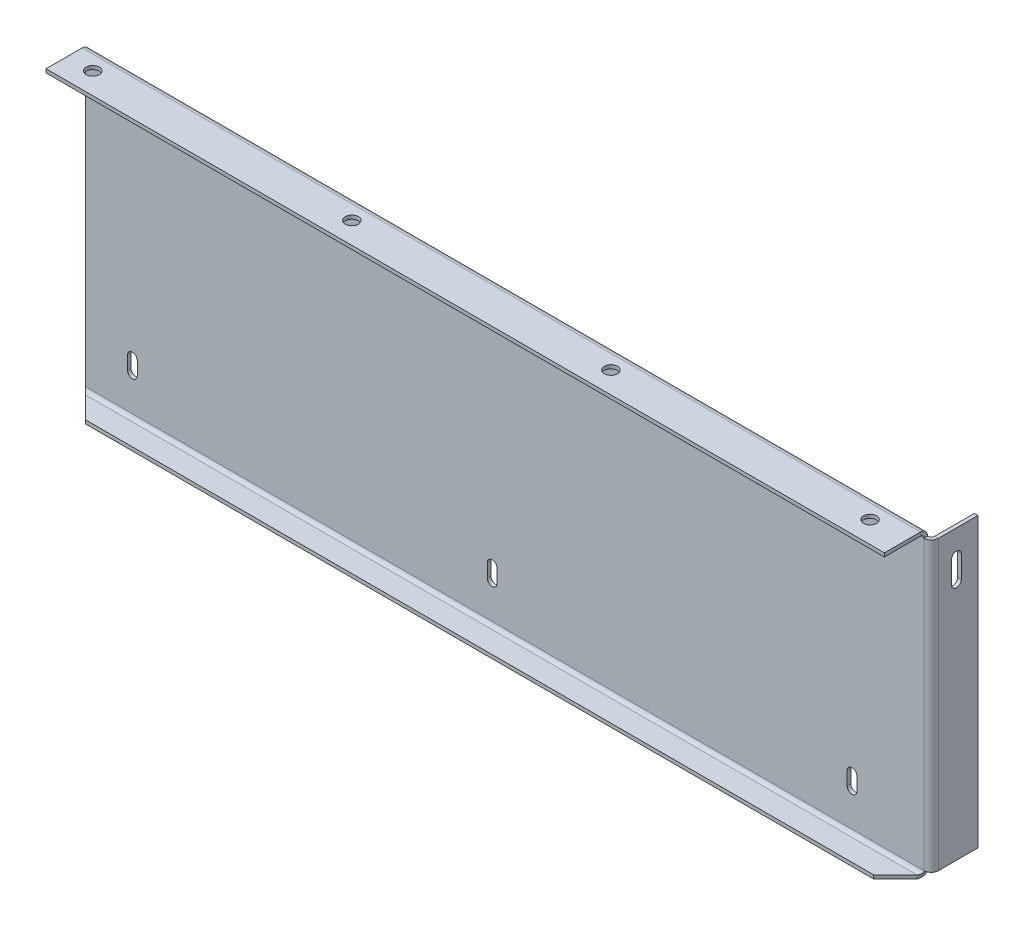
ISO-10303-21;
HEADER;
FILE_DESCRIPTION(('STEP AP214'),'2;1');
FILE_NAME('part.step','',(''),(''),'','','');
FILE_SCHEMA(('AUTOMOTIVE_DESIGN { 1 0 10303 214 1 1 1 1 }'));
ENDSEC;
DATA;
#1=APPLICATION_CONTEXT('core data for automotive mechanical design processes');
#2=APPLICATION_PROTOCOL_DEFINITION('international standard','automotive_design',2000,#1);
#3=PRODUCT_CONTEXT('',#1,'mechanical');
#4=PRODUCT('Part','Part','',(#3));
#5=PRODUCT_RELATED_PRODUCT_CATEGORY('part','',(#4));
#6=PRODUCT_DEFINITION_FORMATION('','',#4);
#7=PRODUCT_DEFINITION_CONTEXT('part definition',#1,'design');
#8=PRODUCT_DEFINITION('design','',#6,#7);
#9=PRODUCT_DEFINITION_SHAPE('','',#8);
#10=(LENGTH_UNIT() NAMED_UNIT(*) SI_UNIT(.MILLI.,.METRE.));
#11=(NAMED_UNIT(*) PLANE_ANGLE_UNIT() SI_UNIT($,.RADIAN.));
#12=(NAMED_UNIT(*) SI_UNIT($,.STERADIAN.) SOLID_ANGLE_UNIT());
#13=UNCERTAINTY_MEASURE_WITH_UNIT(LENGTH_MEASURE(1.E-05),#10,'distance_accuracy_value','');
#14=(GEOMETRIC_REPRESENTATION_CONTEXT(3) GLOBAL_UNCERTAINTY_ASSIGNED_CONTEXT((#13)) GLOBAL_UNIT_ASSIGNED_CONTEXT((#10,
#11,#12)) REPRESENTATION_CONTEXT('',''));
#15=CARTESIAN_POINT('',(0.,0.,0.));
#16=DIRECTION('',(0.,0.,1.));
#17=DIRECTION('',(1.,0.,0.));
#18=AXIS2_PLACEMENT_3D('',#15,#16,#17);
#19=CARTESIAN_POINT('',(582.5,5.,4.99999999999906));
#20=DIRECTION('',(-1.,0.,0.));
#21=DIRECTION('',(0.,0.,1.));
#22=AXIS2_PLACEMENT_3D('',#19,#20,#21);
#23=CYLINDRICAL_SURFACE('',#22,2.5);
#24=DIRECTION('',(-1.,0.,0.));
#25=VECTOR('',#24,1.);
#26=CARTESIAN_POINT('',(582.5,5.,2.49999999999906));
#27=LINE('',#26,#25);
#28=CARTESIAN_POINT('',(582.5,5.,2.49999999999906));
#29=VERTEX_POINT('',#28);
#30=CARTESIAN_POINT('',(0.,5.,2.5));
#31=VERTEX_POINT('',#30);
#32=EDGE_CURVE('E621',#29,#31,#27,.T.);
#33=ORIENTED_EDGE('',*,*,#32,.T.);
#34=CARTESIAN_POINT('',(2.49999999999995,5.,4.99999999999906));
#35=DIRECTION('',(0.707106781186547,0.,-0.707106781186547));
#36=DIRECTION('',(-0.707106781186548,0.,-0.707106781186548));
#37=AXIS2_PLACEMENT_3D('',#34,#35,#36);
#38=ELLIPSE('',#37,3.53553390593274,2.5);
#39=CARTESIAN_POINT('',(2.50000000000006,2.49999999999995,4.99999999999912));
#40=VERTEX_POINT('',#39);
#41=EDGE_CURVE('E373',#31,#40,#38,.F.);
#42=ORIENTED_EDGE('',*,*,#41,.T.);
#43=DIRECTION('',(-1.,0.,0.));
#44=VECTOR('',#43,1.);
#45=CARTESIAN_POINT('',(582.5,2.49999999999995,4.99999999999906));
#46=LINE('',#45,#44);
#47=CARTESIAN_POINT('',(580.,2.49999999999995,4.99999999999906));
#48=VERTEX_POINT('',#47);
#49=EDGE_CURVE('E617',#48,#40,#46,.T.);
#50=ORIENTED_EDGE('',*,*,#49,.F.);
#51=CARTESIAN_POINT('',(580.,5.,4.99999999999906));
#52=DIRECTION('',(-0.707106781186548,0.,-0.707106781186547));
#53=DIRECTION('',(-0.707106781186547,0.,0.707106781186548));
#54=AXIS2_PLACEMENT_3D('',#51,#52,#53);
#55=ELLIPSE('',#54,3.53553390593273,2.5);
#56=EDGE_CURVE('E392',#48,#29,#55,.F.);
#57=ORIENTED_EDGE('',*,*,#56,.T.);
#58=EDGE_LOOP('',(#33,#42,#50,#57));
#59=FACE_BOUND('',#58,.T.);
#60=ADVANCED_FACE('F64',(#59),#23,.F.);
#61=CARTESIAN_POINT('',(582.499999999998,2.50000000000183,19.9999999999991));
#62=DIRECTION('',(0.,1.,0.));
#63=DIRECTION('',(0.,0.,1.));
#64=AXIS2_PLACEMENT_3D('',#61,#62,#63);
#65=PLANE('',#64);
#66=ORIENTED_EDGE('',*,*,#49,.T.);
#67=DIRECTION('',(0.707106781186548,0.,0.707106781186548));
#68=VECTOR('',#67,1.);
#69=CARTESIAN_POINT('',(0.,2.49999999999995,2.5));
#70=LINE('',#69,#68);
#71=CARTESIAN_POINT('',(17.5,2.50000000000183,20.));
#72=VERTEX_POINT('',#71);
#73=EDGE_CURVE('E380',#40,#72,#70,.T.);
#74=ORIENTED_EDGE('',*,*,#73,.T.);
#75=DIRECTION('',(-1.,0.,0.));
#76=VECTOR('',#75,1.);
#77=CARTESIAN_POINT('',(582.499999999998,2.50000000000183,19.9999999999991));
#78=LINE('',#77,#76);
#79=CARTESIAN_POINT('',(564.999999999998,2.50000000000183,19.9999999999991));
#80=VERTEX_POINT('',#79);
#81=EDGE_CURVE('E613',#80,#72,#78,.T.);
#82=ORIENTED_EDGE('',*,*,#81,.F.);
#83=DIRECTION('',(0.707106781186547,0.,-0.707106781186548));
#84=VECTOR('',#83,1.);
#85=CARTESIAN_POINT('',(582.5,2.49999999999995,2.49999999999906));
#86=LINE('',#85,#84);
#87=EDGE_CURVE('E402',#80,#48,#86,.T.);
#88=ORIENTED_EDGE('',*,*,#87,.T.);
#89=EDGE_LOOP('',(#66,#74,#82,#88));
#90=FACE_BOUND('',#89,.T.);
#91=ADVANCED_FACE('F726',(#90),#65,.T.);
#92=CARTESIAN_POINT('',(582.499999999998,1.88737914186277E-12,19.9999999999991));
#93=DIRECTION('',(0.,0.,1.));
#94=DIRECTION('',(1.,0.,0.));
#95=AXIS2_PLACEMENT_3D('',#92,#93,#94);
#96=PLANE('',#95);
#97=ORIENTED_EDGE('',*,*,#81,.T.);
#98=DIRECTION('',(0.,1.,0.));
#99=VECTOR('',#98,1.);
#100=CARTESIAN_POINT('',(17.5,2.50000000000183,20.));
#101=LINE('',#100,#99);
#102=CARTESIAN_POINT('',(17.5,1.88737914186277E-12,20.));
#103=VERTEX_POINT('',#102);
#104=EDGE_CURVE('E387',#72,#103,#101,.F.);
#105=ORIENTED_EDGE('',*,*,#104,.T.);
#106=DIRECTION('',(-1.,0.,0.));
#107=VECTOR('',#106,1.);
#108=CARTESIAN_POINT('',(582.499999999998,1.88737914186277E-12,19.9999999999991));
#109=LINE('',#108,#107);
#110=CARTESIAN_POINT('',(564.999999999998,1.88737914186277E-12,19.9999999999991));
#111=VERTEX_POINT('',#110);
#112=EDGE_CURVE('E609',#111,#103,#109,.T.);
#113=ORIENTED_EDGE('',*,*,#112,.F.);
#114=DIRECTION('',(0.,1.,0.));
#115=VECTOR('',#114,1.);
#116=CARTESIAN_POINT('',(564.999999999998,2.50000000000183,19.9999999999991));
#117=LINE('',#116,#115);
#118=EDGE_CURVE('E410',#80,#111,#117,.F.);
#119=ORIENTED_EDGE('',*,*,#118,.F.);
#120=EDGE_LOOP('',(#97,#105,#113,#119));
#121=FACE_BOUND('',#120,.T.);
#122=ADVANCED_FACE('F732',(#121),#96,.T.);
#123=CARTESIAN_POINT('',(582.499999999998,1.88737914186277E-12,19.9999999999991));
#124=DIRECTION('',(0.,1.,0.));
#125=DIRECTION('',(0.,0.,1.));
#126=AXIS2_PLACEMENT_3D('',#123,#124,#125);
#127=PLANE('',#126);
#128=DIRECTION('',(0.707106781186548,0.,0.707106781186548));
#129=VECTOR('',#128,1.);
#130=CARTESIAN_POINT('',(0.,0.,2.5));
#131=LINE('',#130,#129);
#132=CARTESIAN_POINT('',(2.50000000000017,0.,4.99999999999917));
#133=VERTEX_POINT('',#132);
#134=EDGE_CURVE('E384',#133,#103,#131,.T.);
#135=ORIENTED_EDGE('',*,*,#134,.F.);
#136=DIRECTION('',(-1.,0.,0.));
#137=VECTOR('',#136,1.);
#138=CARTESIAN_POINT('',(582.5,0.,4.99999999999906));
#139=LINE('',#138,#137);
#140=CARTESIAN_POINT('',(580.,0.,4.99999999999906));
#141=VERTEX_POINT('',#140);
#142=EDGE_CURVE('E605',#141,#133,#139,.T.);
#143=ORIENTED_EDGE('',*,*,#142,.F.);
#144=DIRECTION('',(0.707106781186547,0.,-0.707106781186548));
#145=VECTOR('',#144,1.);
#146=CARTESIAN_POINT('',(582.5,0.,2.49999999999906));
#147=LINE('',#146,#145);
#148=EDGE_CURVE('E406',#111,#141,#147,.T.);
#149=ORIENTED_EDGE('',*,*,#148,.F.);
#150=ORIENTED_EDGE('',*,*,#112,.T.);
#151=EDGE_LOOP('',(#135,#143,#149,#150));
#152=FACE_BOUND('',#151,.T.);
#153=ADVANCED_FACE('F775',(#152),#127,.F.);
#154=CARTESIAN_POINT('',(582.5,5.,4.99999999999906));
#155=DIRECTION('',(-1.,0.,0.));
#156=DIRECTION('',(0.,0.,1.));
#157=AXIS2_PLACEMENT_3D('',#154,#155,#156);
#158=CYLINDRICAL_SURFACE('',#157,5.);
#159=CARTESIAN_POINT('',(2.49999999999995,5.,4.99999999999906));
#160=DIRECTION('',(0.894427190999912,0.,-0.447213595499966));
#161=DIRECTION('',(-0.447213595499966,0.,-0.894427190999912));
#162=AXIS2_PLACEMENT_3D('',#159,#160,#161);
#163=ELLIPSE('',#162,5.5901699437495,5.);
#164=CARTESIAN_POINT('',(0.,5.,0.));
#165=VERTEX_POINT('',#164);
#166=EDGE_CURVE('E377',#165,#133,#163,.F.);
#167=ORIENTED_EDGE('',*,*,#166,.F.);
#168=DIRECTION('',(-1.,0.,0.));
#169=VECTOR('',#168,1.);
#170=CARTESIAN_POINT('',(582.5,5.,-9.43689570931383E-13));
#171=LINE('',#170,#169);
#172=CARTESIAN_POINT('',(582.5,5.,-9.43689570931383E-13));
#173=VERTEX_POINT('',#172);
#174=EDGE_CURVE('E601',#173,#165,#171,.T.);
#175=ORIENTED_EDGE('',*,*,#174,.F.);
#176=CARTESIAN_POINT('',(580.,5.,4.99999999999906));
#177=DIRECTION('',(-0.89442719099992,0.,-0.44721359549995));
#178=DIRECTION('',(-0.44721359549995,0.,0.89442719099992));
#179=AXIS2_PLACEMENT_3D('',#176,#177,#178);
#180=ELLIPSE('',#179,5.59016994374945,5.);
#181=EDGE_CURVE('E399',#141,#173,#180,.F.);
#182=ORIENTED_EDGE('',*,*,#181,.F.);
#183=ORIENTED_EDGE('',*,*,#142,.T.);
#184=EDGE_LOOP('',(#167,#175,#182,#183));
#185=FACE_BOUND('',#184,.T.);
#186=ADVANCED_FACE('F770',(#185),#158,.T.);
#187=CARTESIAN_POINT('',(0.,2.49999999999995,5.));
#188=DIRECTION('',(-1.,0.,0.));
#189=DIRECTION('',(0.,0.,1.));
#190=AXIS2_PLACEMENT_3D('',#187,#188,#189);
#191=PLANE('',#190);
#192=DIRECTION('',(0.,1.,0.));
#193=VECTOR('',#192,1.);
#194=CARTESIAN_POINT('',(0.,0.,0.));
#195=LINE('',#194,#193);
#196=CARTESIAN_POINT('',(0.,205.,-9.43689570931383E-13));
#197=VERTEX_POINT('',#196);
#198=EDGE_CURVE('E559',#165,#197,#195,.T.);
#199=ORIENTED_EDGE('',*,*,#198,.F.);
#200=DIRECTION('',(0.,0.,1.));
#201=VECTOR('',#200,1.);
#202=CARTESIAN_POINT('',(0.,5.,0.));
#203=LINE('',#202,#201);
#204=EDGE_CURVE('E652',#165,#31,#203,.T.);
#205=ORIENTED_EDGE('',*,*,#204,.T.);
#206=DIRECTION('',(0.,1.,0.));
#207=VECTOR('',#206,1.);
#208=CARTESIAN_POINT('',(0.,0.,2.5));
#209=LINE('',#208,#207);
#210=CARTESIAN_POINT('',(0.,205.,2.49999999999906));
#211=VERTEX_POINT('',#210);
#212=EDGE_CURVE('E555',#31,#211,#209,.T.);
#213=ORIENTED_EDGE('',*,*,#212,.T.);
#214=DIRECTION('',(0.,0.,-1.));
#215=VECTOR('',#214,1.);
#216=CARTESIAN_POINT('',(0.,205.,2.49999999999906));
#217=LINE('',#216,#215);
#218=EDGE_CURVE('E639',#211,#197,#217,.T.);
#219=ORIENTED_EDGE('',*,*,#218,.T.);
#220=EDGE_LOOP('',(#199,#205,#213,#219));
#221=FACE_BOUND('',#220,.T.);
#222=ADVANCED_FACE('F767',(#221),#191,.T.);
#223=CARTESIAN_POINT('',(582.5,205.,0.));
#224=DIRECTION('',(1.,0.,0.));
#225=DIRECTION('',(0.,0.,-1.));
#226=AXIS2_PLACEMENT_3D('',#223,#224,#225);
#227=PLANE('',#226);
#228=DIRECTION('',(0.,0.,1.));
#229=VECTOR('',#228,1.);
#230=CARTESIAN_POINT('',(582.5,205.,0.));
#231=LINE('',#230,#229);
#232=CARTESIAN_POINT('',(582.5,205.,0.));
#233=VERTEX_POINT('',#232);
#234=CARTESIAN_POINT('',(582.5,205.,2.5));
#235=VERTEX_POINT('',#234);
#236=EDGE_CURVE('E648',#233,#235,#231,.T.);
#237=ORIENTED_EDGE('',*,*,#236,.F.);
#238=CARTESIAN_POINT('',(582.5,205.,5.));
#239=DIRECTION('',(-1.,0.,0.));
#240=DIRECTION('',(0.,0.,1.));
#241=AXIS2_PLACEMENT_3D('',#238,#239,#240);
#242=CIRCLE('',#241,5.);
#243=CARTESIAN_POINT('',(582.5,210.,5.));
#244=VERTEX_POINT('',#243);
#245=EDGE_CURVE('E589',#233,#244,#242,.F.);
#246=ORIENTED_EDGE('',*,*,#245,.T.);
#247=DIRECTION('',(0.,1.,0.));
#248=VECTOR('',#247,1.);
#249=CARTESIAN_POINT('',(582.5,207.5,5.));
#250=LINE('',#249,#248);
#251=CARTESIAN_POINT('',(582.5,207.5,5.));
#252=VERTEX_POINT('',#251);
#253=EDGE_CURVE('E645',#252,#244,#250,.T.);
#254=ORIENTED_EDGE('',*,*,#253,.F.);
#255=CARTESIAN_POINT('',(582.5,205.,5.));
#256=DIRECTION('',(1.,0.,0.));
#257=DIRECTION('',(0.,0.,-1.));
#258=AXIS2_PLACEMENT_3D('',#255,#256,#257);
#259=CIRCLE('',#258,2.5);
#260=EDGE_CURVE('E578',#235,#252,#259,.T.);
#261=ORIENTED_EDGE('',*,*,#260,.F.);
#262=EDGE_LOOP('',(#237,#246,#254,#261));
#263=FACE_BOUND('',#262,.T.);
#264=ADVANCED_FACE('F764',(#263),#227,.T.);
#265=CARTESIAN_POINT('',(0.,210.,4.99999999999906));
#266=DIRECTION('',(-1.,0.,0.));
#267=DIRECTION('',(0.,0.,1.));
#268=AXIS2_PLACEMENT_3D('',#265,#266,#267);
#269=PLANE('',#268);
#270=DIRECTION('',(0.,-1.,0.));
#271=VECTOR('',#270,1.);
#272=CARTESIAN_POINT('',(0.,210.,4.99999999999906));
#273=LINE('',#272,#271);
#274=CARTESIAN_POINT('',(0.,210.,4.99999999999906));
#275=VERTEX_POINT('',#274);
#276=CARTESIAN_POINT('',(0.,207.5,4.99999999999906));
#277=VERTEX_POINT('',#276);
#278=EDGE_CURVE('E642',#275,#277,#273,.T.);
#279=ORIENTED_EDGE('',*,*,#278,.F.);
#280=CARTESIAN_POINT('',(0.,205.,4.99999999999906));
#281=DIRECTION('',(-1.,0.,0.));
#282=DIRECTION('',(0.,0.,1.));
#283=AXIS2_PLACEMENT_3D('',#280,#281,#282);
#284=CIRCLE('',#283,5.);
#285=EDGE_CURVE('E563',#197,#275,#284,.F.);
#286=ORIENTED_EDGE('',*,*,#285,.F.);
#287=ORIENTED_EDGE('',*,*,#218,.F.);
#288=CARTESIAN_POINT('',(0.,205.,4.99999999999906));
#289=DIRECTION('',(1.,0.,0.));
#290=DIRECTION('',(0.,0.,-1.));
#291=AXIS2_PLACEMENT_3D('',#288,#289,#290);
#292=CIRCLE('',#291,2.5);
#293=EDGE_CURVE('E551',#211,#277,#292,.T.);
#294=ORIENTED_EDGE('',*,*,#293,.T.);
#295=EDGE_LOOP('',(#279,#286,#287,#294));
#296=FACE_BOUND('',#295,.T.);
#297=ADVANCED_FACE('F760',(#296),#269,.T.);
#298=CARTESIAN_POINT('',(0.,205.,2.49999999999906));
#299=DIRECTION('',(-1.,0.,0.));
#300=DIRECTION('',(0.,0.,1.));
#301=AXIS2_PLACEMENT_3D('',#298,#299,#300);
#302=PLANE('',#301);
#303=DIRECTION('',(0.,0.,1.));
#304=VECTOR('',#303,1.);
#305=CARTESIAN_POINT('',(0.,210.,-9.43689570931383E-13));
#306=LINE('',#305,#304);
#307=CARTESIAN_POINT('',(0.,210.000000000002,29.9999999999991));
#308=VERTEX_POINT('',#307);
#309=EDGE_CURVE('E539',#275,#308,#306,.T.);
#310=ORIENTED_EDGE('',*,*,#309,.F.);
#311=ORIENTED_EDGE('',*,*,#278,.T.);
#312=DIRECTION('',(0.,0.,-1.));
#313=VECTOR('',#312,1.);
#314=CARTESIAN_POINT('',(0.,207.5,-9.43689570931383E-13));
#315=LINE('',#314,#313);
#316=CARTESIAN_POINT('',(0.,207.500000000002,29.9999999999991));
#317=VERTEX_POINT('',#316);
#318=EDGE_CURVE('E547',#277,#317,#315,.F.);
#319=ORIENTED_EDGE('',*,*,#318,.T.);
#320=DIRECTION('',(0.,1.,0.));
#321=VECTOR('',#320,1.);
#322=CARTESIAN_POINT('',(0.,207.500000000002,29.9999999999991));
#323=LINE('',#322,#321);
#324=EDGE_CURVE('E543',#317,#308,#323,.T.);
#325=ORIENTED_EDGE('',*,*,#324,.T.);
#326=EDGE_LOOP('',(#310,#311,#319,#325));
#327=FACE_BOUND('',#326,.T.);
#328=ADVANCED_FACE('F756',(#327),#302,.T.);
#329=CARTESIAN_POINT('',(582.5,210.,0.));
#330=DIRECTION('',(0.,-1.,0.));
#331=DIRECTION('',(0.,0.,-1.));
#332=AXIS2_PLACEMENT_3D('',#329,#330,#331);
#333=PLANE('',#332);
#334=CARTESIAN_POINT('',(17.4999999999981,210.000000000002,15.));
#335=DIRECTION('',(0.,1.,0.));
#336=DIRECTION('',(0.,0.,1.));
#337=AXIS2_PLACEMENT_3D('',#334,#335,#336);
#338=CIRCLE('',#337,4.54999999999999);
#339=CARTESIAN_POINT('',(17.4999999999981,210.000000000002,19.55));
#340=VERTEX_POINT('',#339);
#341=EDGE_CURVE('E514',#340,#340,#338,.T.);
#342=ORIENTED_EDGE('',*,*,#341,.F.);
#343=EDGE_LOOP('',(#342));
#344=FACE_BOUND('',#343,.T.);
#345=CARTESIAN_POINT('',(197.5,210.000000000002,14.9999999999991));
#346=DIRECTION('',(0.,1.,0.));
#347=DIRECTION('',(0.,0.,1.));
#348=AXIS2_PLACEMENT_3D('',#345,#346,#347);
#349=CIRCLE('',#348,4.55);
#350=CARTESIAN_POINT('',(197.5,210.000000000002,19.5499999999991));
#351=VERTEX_POINT('',#350);
#352=EDGE_CURVE('E521',#351,#351,#349,.T.);
#353=ORIENTED_EDGE('',*,*,#352,.F.);
#354=EDGE_LOOP('',(#353));
#355=FACE_BOUND('',#354,.T.);
#356=CARTESIAN_POINT('',(557.499999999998,210.,14.9999999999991));
#357=DIRECTION('',(0.,1.,0.));
#358=DIRECTION('',(0.,0.,1.));
#359=AXIS2_PLACEMENT_3D('',#356,#357,#358);
#360=CIRCLE('',#359,4.54999999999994);
#361=CARTESIAN_POINT('',(557.499999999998,210.,19.549999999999));
#362=VERTEX_POINT('',#361);
#363=EDGE_CURVE('E526',#362,#362,#360,.T.);
#364=ORIENTED_EDGE('',*,*,#363,.F.);
#365=EDGE_LOOP('',(#364));
#366=FACE_BOUND('',#365,.T.);
#367=CARTESIAN_POINT('',(377.5,210.,15.));
#368=DIRECTION('',(0.,1.,0.));
#369=DIRECTION('',(0.,0.,1.));
#370=AXIS2_PLACEMENT_3D('',#367,#368,#369);
#371=CIRCLE('',#370,4.55);
#372=CARTESIAN_POINT('',(377.5,210.,19.55));
#373=VERTEX_POINT('',#372);
#374=EDGE_CURVE('E531',#373,#373,#371,.T.);
#375=ORIENTED_EDGE('',*,*,#374,.F.);
#376=EDGE_LOOP('',(#375));
#377=FACE_BOUND('',#376,.T.);
#378=ORIENTED_EDGE('',*,*,#309,.T.);
#379=DIRECTION('',(-1.,0.,0.));
#380=VECTOR('',#379,1.);
#381=CARTESIAN_POINT('',(582.5,210.000000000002,30.));
#382=LINE('',#381,#380);
#383=CARTESIAN_POINT('',(582.5,210.000000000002,30.));
#384=VERTEX_POINT('',#383);
#385=EDGE_CURVE('E636',#384,#308,#382,.T.);
#386=ORIENTED_EDGE('',*,*,#385,.F.);
#387=DIRECTION('',(0.,0.,1.));
#388=VECTOR('',#387,1.);
#389=CARTESIAN_POINT('',(582.5,210.,0.));
#390=LINE('',#389,#388);
#391=EDGE_CURVE('E567',#244,#384,#390,.T.);
#392=ORIENTED_EDGE('',*,*,#391,.F.);
#393=DIRECTION('',(-1.,0.,0.));
#394=VECTOR('',#393,1.);
#395=CARTESIAN_POINT('',(582.5,210.,5.));
#396=LINE('',#395,#394);
#397=EDGE_CURVE('E593',#244,#275,#396,.T.);
#398=ORIENTED_EDGE('',*,*,#397,.T.);
#399=EDGE_LOOP('',(#378,#386,#392,#398));
#400=FACE_BOUND('',#399,.T.);
#401=ADVANCED_FACE('F752',(#344,#355,#366,#377,#400),#333,.F.);
#402=CARTESIAN_POINT('',(582.5,207.500000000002,30.));
#403=DIRECTION('',(0.,0.,1.));
#404=DIRECTION('',(1.,0.,0.));
#405=AXIS2_PLACEMENT_3D('',#402,#403,#404);
#406=PLANE('',#405);
#407=ORIENTED_EDGE('',*,*,#324,.F.);
#408=DIRECTION('',(-1.,0.,0.));
#409=VECTOR('',#408,1.);
#410=CARTESIAN_POINT('',(582.5,207.500000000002,30.));
#411=LINE('',#410,#409);
#412=CARTESIAN_POINT('',(582.5,207.500000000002,30.));
#413=VERTEX_POINT('',#412);
#414=EDGE_CURVE('E633',#413,#317,#411,.T.);
#415=ORIENTED_EDGE('',*,*,#414,.F.);
#416=DIRECTION('',(0.,1.,0.));
#417=VECTOR('',#416,1.);
#418=CARTESIAN_POINT('',(582.5,207.500000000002,30.));
#419=LINE('',#418,#417);
#420=EDGE_CURVE('E570',#413,#384,#419,.T.);
#421=ORIENTED_EDGE('',*,*,#420,.T.);
#422=ORIENTED_EDGE('',*,*,#385,.T.);
#423=EDGE_LOOP('',(#407,#415,#421,#422));
#424=FACE_BOUND('',#423,.T.);
#425=ADVANCED_FACE('F748',(#424),#406,.T.);
#426=CARTESIAN_POINT('',(582.5,207.5,0.));
#427=DIRECTION('',(0.,-1.,0.));
#428=DIRECTION('',(0.,0.,-1.));
#429=AXIS2_PLACEMENT_3D('',#426,#427,#428);
#430=PLANE('',#429);
#431=CARTESIAN_POINT('',(17.4999999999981,207.500000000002,15.));
#432=DIRECTION('',(0.,-1.,0.));
#433=DIRECTION('',(0.,0.,-1.));
#434=AXIS2_PLACEMENT_3D('',#431,#432,#433);
#435=CIRCLE('',#434,4.55);
#436=CARTESIAN_POINT('',(17.4999999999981,207.500000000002,10.45));
#437=VERTEX_POINT('',#436);
#438=EDGE_CURVE('E520',#437,#437,#435,.T.);
#439=ORIENTED_EDGE('',*,*,#438,.F.);
#440=EDGE_LOOP('',(#439));
#441=FACE_BOUND('',#440,.T.);
#442=CARTESIAN_POINT('',(197.5,207.500000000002,14.9999999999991));
#443=DIRECTION('',(0.,-1.,0.));
#444=DIRECTION('',(0.,0.,-1.));
#445=AXIS2_PLACEMENT_3D('',#442,#443,#444);
#446=CIRCLE('',#445,4.55);
#447=CARTESIAN_POINT('',(197.5,207.500000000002,10.4499999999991));
#448=VERTEX_POINT('',#447);
#449=EDGE_CURVE('E525',#448,#448,#446,.T.);
#450=ORIENTED_EDGE('',*,*,#449,.F.);
#451=EDGE_LOOP('',(#450));
#452=FACE_BOUND('',#451,.T.);
#453=CARTESIAN_POINT('',(557.499999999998,207.5,14.9999999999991));
#454=DIRECTION('',(0.,-1.,0.));
#455=DIRECTION('',(0.,0.,-1.));
#456=AXIS2_PLACEMENT_3D('',#453,#454,#455);
#457=CIRCLE('',#456,4.54999999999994);
#458=CARTESIAN_POINT('',(557.499999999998,207.5,10.4499999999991));
#459=VERTEX_POINT('',#458);
#460=EDGE_CURVE('E530',#459,#459,#457,.T.);
#461=ORIENTED_EDGE('',*,*,#460,.F.);
#462=EDGE_LOOP('',(#461));
#463=FACE_BOUND('',#462,.T.);
#464=CARTESIAN_POINT('',(377.5,207.5,15.));
#465=DIRECTION('',(0.,-1.,0.));
#466=DIRECTION('',(0.,0.,-1.));
#467=AXIS2_PLACEMENT_3D('',#464,#465,#466);
#468=CIRCLE('',#467,4.55);
#469=CARTESIAN_POINT('',(377.5,207.5,10.45));
#470=VERTEX_POINT('',#469);
#471=EDGE_CURVE('E535',#470,#470,#468,.T.);
#472=ORIENTED_EDGE('',*,*,#471,.F.);
#473=EDGE_LOOP('',(#472));
#474=FACE_BOUND('',#473,.T.);
#475=ORIENTED_EDGE('',*,*,#318,.F.);
#476=DIRECTION('',(-1.,0.,0.));
#477=VECTOR('',#476,1.);
#478=CARTESIAN_POINT('',(582.5,207.5,5.));
#479=LINE('',#478,#477);
#480=EDGE_CURVE('E629',#252,#277,#479,.T.);
#481=ORIENTED_EDGE('',*,*,#480,.F.);
#482=DIRECTION('',(0.,0.,-1.));
#483=VECTOR('',#482,1.);
#484=CARTESIAN_POINT('',(582.5,207.5,0.));
#485=LINE('',#484,#483);
#486=EDGE_CURVE('E574',#252,#413,#485,.F.);
#487=ORIENTED_EDGE('',*,*,#486,.T.);
#488=ORIENTED_EDGE('',*,*,#414,.T.);
#489=EDGE_LOOP('',(#475,#481,#487,#488));
#490=FACE_BOUND('',#489,.T.);
#491=ADVANCED_FACE('F744',(#441,#452,#463,#474,#490),#430,.T.);
#492=CARTESIAN_POINT('',(582.5,205.,5.));
#493=DIRECTION('',(-1.,0.,0.));
#494=DIRECTION('',(0.,0.,1.));
#495=AXIS2_PLACEMENT_3D('',#492,#493,#494);
#496=CYLINDRICAL_SURFACE('',#495,2.5);
#497=ORIENTED_EDGE('',*,*,#293,.F.);
#498=DIRECTION('',(-1.,0.,0.));
#499=VECTOR('',#498,1.);
#500=CARTESIAN_POINT('',(582.5,205.,2.5));
#501=LINE('',#500,#499);
#502=EDGE_CURVE('E625',#235,#211,#501,.T.);
#503=ORIENTED_EDGE('',*,*,#502,.F.);
#504=ORIENTED_EDGE('',*,*,#260,.T.);
#505=ORIENTED_EDGE('',*,*,#480,.T.);
#506=EDGE_LOOP('',(#497,#503,#504,#505));
#507=FACE_BOUND('',#506,.T.);
#508=ADVANCED_FACE('F740',(#507),#496,.F.);
#509=CARTESIAN_POINT('',(582.5,0.,2.49999999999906));
#510=DIRECTION('',(0.,0.,1.));
#511=DIRECTION('',(1.,0.,0.));
#512=AXIS2_PLACEMENT_3D('',#509,#510,#511);
#513=PLANE('',#512);
#514=CARTESIAN_POINT('',(12.5,187.5,2.49999999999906));
#515=DIRECTION('',(0.,0.,1.));
#516=DIRECTION('',(1.,0.,0.));
#517=AXIS2_PLACEMENT_3D('',#514,#515,#516);
#518=CIRCLE('',#517,4.54999999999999);
#519=CARTESIAN_POINT('',(17.0499999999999,187.5,2.49999999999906));
#520=VERTEX_POINT('',#519);
#521=EDGE_CURVE('E288',#520,#520,#518,.T.);
#522=ORIENTED_EDGE('',*,*,#521,.F.);
#523=EDGE_LOOP('',(#522));
#524=FACE_BOUND('',#523,.T.);
#525=CARTESIAN_POINT('',(282.499999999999,38.5999999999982,2.49999999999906));
#526=DIRECTION('',(0.,0.,1.));
#527=DIRECTION('',(1.,0.,0.));
#528=AXIS2_PLACEMENT_3D('',#525,#526,#527);
#529=CIRCLE('',#528,3.39999999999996);
#530=CARTESIAN_POINT('',(279.099999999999,38.5999999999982,2.5));
#531=VERTEX_POINT('',#530);
#532=CARTESIAN_POINT('',(285.899999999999,38.5999999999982,2.49999999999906));
#533=VERTEX_POINT('',#532);
#534=EDGE_CURVE('E325',#531,#533,#529,.F.);
#535=ORIENTED_EDGE('',*,*,#534,.T.);
#536=DIRECTION('',(0.,-1.,0.));
#537=VECTOR('',#536,1.);
#538=CARTESIAN_POINT('',(285.899999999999,38.5999999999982,2.49999999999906));
#539=LINE('',#538,#537);
#540=CARTESIAN_POINT('',(285.899999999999,29.3999999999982,2.49999999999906));
#541=VERTEX_POINT('',#540);
#542=EDGE_CURVE('E287',#533,#541,#539,.T.);
#543=ORIENTED_EDGE('',*,*,#542,.T.);
#544=CARTESIAN_POINT('',(282.499999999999,29.3999999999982,2.49999999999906));
#545=DIRECTION('',(0.,0.,1.));
#546=DIRECTION('',(1.,0.,0.));
#547=AXIS2_PLACEMENT_3D('',#544,#545,#546);
#548=CIRCLE('',#547,3.39999999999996);
#549=CARTESIAN_POINT('',(279.099999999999,29.3999999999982,2.5));
#550=VERTEX_POINT('',#549);
#551=EDGE_CURVE('E295',#541,#550,#548,.F.);
#552=ORIENTED_EDGE('',*,*,#551,.T.);
#553=DIRECTION('',(0.,1.,0.));
#554=VECTOR('',#553,1.);
#555=CARTESIAN_POINT('',(279.099999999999,38.5999999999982,2.5));
#556=LINE('',#555,#554);
#557=EDGE_CURVE('E318',#550,#531,#556,.T.);
#558=ORIENTED_EDGE('',*,*,#557,.T.);
#559=EDGE_LOOP('',(#535,#543,#552,#558));
#560=FACE_BOUND('',#559,.T.);
#561=CARTESIAN_POINT('',(532.5,38.6,2.49999999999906));
#562=DIRECTION('',(0.,0.,1.));
#563=DIRECTION('',(1.,0.,0.));
#564=AXIS2_PLACEMENT_3D('',#561,#562,#563);
#565=CIRCLE('',#564,3.39999999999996);
#566=CARTESIAN_POINT('',(529.1,38.6,2.5));
#567=VERTEX_POINT('',#566);
#568=CARTESIAN_POINT('',(535.9,38.6,2.49999999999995));
#569=VERTEX_POINT('',#568);
#570=EDGE_CURVE('E337',#567,#569,#565,.F.);
#571=ORIENTED_EDGE('',*,*,#570,.T.);
#572=DIRECTION('',(0.,-1.,0.));
#573=VECTOR('',#572,1.);
#574=CARTESIAN_POINT('',(535.9,38.6,2.49999999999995));
#575=LINE('',#574,#573);
#576=CARTESIAN_POINT('',(535.9,29.4,2.49999999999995));
#577=VERTEX_POINT('',#576);
#578=EDGE_CURVE('E360',#569,#577,#575,.T.);
#579=ORIENTED_EDGE('',*,*,#578,.T.);
#580=CARTESIAN_POINT('',(532.5,29.4,2.49999999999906));
#581=DIRECTION('',(0.,0.,1.));
#582=DIRECTION('',(1.,0.,0.));
#583=AXIS2_PLACEMENT_3D('',#580,#581,#582);
#584=CIRCLE('',#583,3.39999999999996);
#585=CARTESIAN_POINT('',(529.1,29.4,2.5));
#586=VERTEX_POINT('',#585);
#587=EDGE_CURVE('E329',#577,#586,#584,.F.);
#588=ORIENTED_EDGE('',*,*,#587,.T.);
#589=DIRECTION('',(0.,1.,0.));
#590=VECTOR('',#589,1.);
#591=CARTESIAN_POINT('',(529.1,38.6,2.5));
#592=LINE('',#591,#590);
#593=EDGE_CURVE('E333',#586,#567,#592,.T.);
#594=ORIENTED_EDGE('',*,*,#593,.T.);
#595=EDGE_LOOP('',(#571,#579,#588,#594));
#596=FACE_BOUND('',#595,.T.);
#597=ORIENTED_EDGE('',*,*,#212,.F.);
#598=ORIENTED_EDGE('',*,*,#32,.F.);
#599=DIRECTION('',(0.,1.,0.));
#600=VECTOR('',#599,1.);
#601=CARTESIAN_POINT('',(582.5,0.,2.49999999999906));
#602=LINE('',#601,#600);
#603=EDGE_CURVE('E582',#29,#235,#602,.T.);
#604=ORIENTED_EDGE('',*,*,#603,.T.);
#605=ORIENTED_EDGE('',*,*,#502,.T.);
#606=EDGE_LOOP('',(#597,#598,#604,#605));
#607=FACE_BOUND('',#606,.T.);
#608=CARTESIAN_POINT('',(32.5,38.6,2.49999999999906));
#609=DIRECTION('',(0.,0.,1.));
#610=DIRECTION('',(1.,0.,0.));
#611=AXIS2_PLACEMENT_3D('',#608,#609,#610);
#612=CIRCLE('',#611,3.39999999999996);
#613=CARTESIAN_POINT('',(29.1,38.6,2.5));
#614=VERTEX_POINT('',#613);
#615=CARTESIAN_POINT('',(35.8999999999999,38.6,2.49999999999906));
#616=VERTEX_POINT('',#615);
#617=EDGE_CURVE('E80',#614,#616,#612,.F.);
#618=ORIENTED_EDGE('',*,*,#617,.T.);
#619=DIRECTION('',(0.,-1.,0.));
#620=VECTOR('',#619,1.);
#621=CARTESIAN_POINT('',(35.8999999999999,38.6,2.49999999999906));
#622=LINE('',#621,#620);
#623=CARTESIAN_POINT('',(35.8999999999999,29.4,2.49999999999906));
#624=VERTEX_POINT('',#623);
#625=EDGE_CURVE('E686',#616,#624,#622,.T.);
#626=ORIENTED_EDGE('',*,*,#625,.T.);
#627=CARTESIAN_POINT('',(32.5,29.4,2.49999999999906));
#628=DIRECTION('',(0.,0.,1.));
#629=DIRECTION('',(1.,0.,0.));
#630=AXIS2_PLACEMENT_3D('',#627,#628,#629);
#631=CIRCLE('',#630,3.39999999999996);
#632=CARTESIAN_POINT('',(29.1,29.4,2.5));
#633=VERTEX_POINT('',#632);
#634=EDGE_CURVE('E87',#624,#633,#631,.F.);
#635=ORIENTED_EDGE('',*,*,#634,.T.);
#636=DIRECTION('',(0.,1.,0.));
#637=VECTOR('',#636,1.);
#638=CARTESIAN_POINT('',(29.1,38.6,2.5));
#639=LINE('',#638,#637);
#640=EDGE_CURVE('E691',#633,#614,#639,.T.);
#641=ORIENTED_EDGE('',*,*,#640,.T.);
#642=EDGE_LOOP('',(#618,#626,#635,#641));
#643=FACE_BOUND('',#642,.T.);
#644=ADVANCED_FACE('F737',(#524,#560,#596,#607,#643),#513,.T.);
#645=CARTESIAN_POINT('',(582.5,0.,-9.43689570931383E-13));
#646=DIRECTION('',(0.,0.,1.));
#647=DIRECTION('',(1.,0.,0.));
#648=AXIS2_PLACEMENT_3D('',#645,#646,#647);
#649=PLANE('',#648);
#650=CARTESIAN_POINT('',(12.5,187.5,-9.43689570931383E-13));
#651=DIRECTION('',(0.,0.,-1.));
#652=DIRECTION('',(-1.,0.,0.));
#653=AXIS2_PLACEMENT_3D('',#650,#651,#652);
#654=CIRCLE('',#653,4.54999999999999);
#655=CARTESIAN_POINT('',(7.94999999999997,187.5,-9.43689570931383E-13));
#656=VERTEX_POINT('',#655);
#657=EDGE_CURVE('E1432',#656,#656,#654,.T.);
#658=ORIENTED_EDGE('',*,*,#657,.F.);
#659=EDGE_LOOP('',(#658));
#660=FACE_BOUND('',#659,.T.);
#661=DIRECTION('',(0.,-1.,0.));
#662=VECTOR('',#661,1.);
#663=CARTESIAN_POINT('',(285.899999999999,38.5999999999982,-8.88178419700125E-13));
#664=LINE('',#663,#662);
#665=CARTESIAN_POINT('',(285.899999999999,38.5999999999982,-9.43689570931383E-13));
#666=VERTEX_POINT('',#665);
#667=CARTESIAN_POINT('',(285.899999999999,29.3999999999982,-8.88178419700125E-13));
#668=VERTEX_POINT('',#667);
#669=EDGE_CURVE('E276',#666,#668,#664,.T.);
#670=ORIENTED_EDGE('',*,*,#669,.F.);
#671=CARTESIAN_POINT('',(282.499999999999,38.5999999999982,-9.43689570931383E-13));
#672=DIRECTION('',(0.,0.,-1.));
#673=DIRECTION('',(1.,0.,0.));
#674=AXIS2_PLACEMENT_3D('',#671,#672,#673);
#675=CIRCLE('',#674,3.39999999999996);
#676=CARTESIAN_POINT('',(279.099999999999,38.5999999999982,0.));
#677=VERTEX_POINT('',#676);
#678=EDGE_CURVE('E322',#677,#666,#675,.T.);
#679=ORIENTED_EDGE('',*,*,#678,.F.);
#680=DIRECTION('',(0.,1.,0.));
#681=VECTOR('',#680,1.);
#682=CARTESIAN_POINT('',(279.099999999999,38.5999999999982,0.));
#683=LINE('',#682,#681);
#684=CARTESIAN_POINT('',(279.099999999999,29.3999999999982,0.));
#685=VERTEX_POINT('',#684);
#686=EDGE_CURVE('E301',#685,#677,#683,.T.);
#687=ORIENTED_EDGE('',*,*,#686,.F.);
#688=CARTESIAN_POINT('',(282.499999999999,29.3999999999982,-9.43689570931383E-13));
#689=DIRECTION('',(0.,0.,-1.));
#690=DIRECTION('',(-1.,0.,0.));
#691=AXIS2_PLACEMENT_3D('',#688,#689,#690);
#692=CIRCLE('',#691,3.39999999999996);
#693=EDGE_CURVE('E292',#668,#685,#692,.T.);
#694=ORIENTED_EDGE('',*,*,#693,.F.);
#695=EDGE_LOOP('',(#670,#679,#687,#694));
#696=FACE_BOUND('',#695,.T.);
#697=DIRECTION('',(0.,-1.,0.));
#698=VECTOR('',#697,1.);
#699=CARTESIAN_POINT('',(535.9,38.6,0.));
#700=LINE('',#699,#698);
#701=CARTESIAN_POINT('',(535.9,38.6,0.));
#702=VERTEX_POINT('',#701);
#703=CARTESIAN_POINT('',(535.9,29.4,0.));
#704=VERTEX_POINT('',#703);
#705=EDGE_CURVE('E344',#702,#704,#700,.T.);
#706=ORIENTED_EDGE('',*,*,#705,.F.);
#707=CARTESIAN_POINT('',(532.5,38.6,-9.43689570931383E-13));
#708=DIRECTION('',(0.,0.,-1.));
#709=DIRECTION('',(1.,0.,0.));
#710=AXIS2_PLACEMENT_3D('',#707,#708,#709);
#711=CIRCLE('',#710,3.39999999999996);
#712=CARTESIAN_POINT('',(529.1,38.6,0.));
#713=VERTEX_POINT('',#712);
#714=EDGE_CURVE('E341',#713,#702,#711,.T.);
#715=ORIENTED_EDGE('',*,*,#714,.F.);
#716=DIRECTION('',(0.,1.,0.));
#717=VECTOR('',#716,1.);
#718=CARTESIAN_POINT('',(529.1,38.6,0.));
#719=LINE('',#718,#717);
#720=CARTESIAN_POINT('',(529.1,29.4,0.));
#721=VERTEX_POINT('',#720);
#722=EDGE_CURVE('E352',#721,#713,#719,.T.);
#723=ORIENTED_EDGE('',*,*,#722,.F.);
#724=CARTESIAN_POINT('',(532.5,29.4,-9.43689570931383E-13));
#725=DIRECTION('',(0.,0.,-1.));
#726=DIRECTION('',(-1.,0.,0.));
#727=AXIS2_PLACEMENT_3D('',#724,#725,#726);
#728=CIRCLE('',#727,3.39999999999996);
#729=EDGE_CURVE('E348',#704,#721,#728,.T.);
#730=ORIENTED_EDGE('',*,*,#729,.F.);
#731=EDGE_LOOP('',(#706,#715,#723,#730));
#732=FACE_BOUND('',#731,.T.);
#733=ORIENTED_EDGE('',*,*,#198,.T.);
#734=DIRECTION('',(-1.,0.,0.));
#735=VECTOR('',#734,1.);
#736=CARTESIAN_POINT('',(582.5,205.,0.));
#737=LINE('',#736,#735);
#738=EDGE_CURVE('E597',#233,#197,#737,.T.);
#739=ORIENTED_EDGE('',*,*,#738,.F.);
#740=DIRECTION('',(0.,1.,0.));
#741=VECTOR('',#740,1.);
#742=CARTESIAN_POINT('',(582.5,0.,-9.43689570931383E-13));
#743=LINE('',#742,#741);
#744=EDGE_CURVE('E586',#173,#233,#743,.T.);
#745=ORIENTED_EDGE('',*,*,#744,.F.);
#746=ORIENTED_EDGE('',*,*,#174,.T.);
#747=EDGE_LOOP('',(#733,#739,#745,#746));
#748=FACE_BOUND('',#747,.T.);
#749=CARTESIAN_POINT('',(32.5,38.6,-9.43689570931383E-13));
#750=DIRECTION('',(0.,0.,-1.));
#751=DIRECTION('',(1.,0.,0.));
#752=AXIS2_PLACEMENT_3D('',#749,#750,#751);
#753=CIRCLE('',#752,3.39999999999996);
#754=CARTESIAN_POINT('',(29.1,38.6,0.));
#755=VERTEX_POINT('',#754);
#756=CARTESIAN_POINT('',(35.8999999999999,38.6,-8.88178419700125E-13));
#757=VERTEX_POINT('',#756);
#758=EDGE_CURVE('E660',#755,#757,#753,.T.);
#759=ORIENTED_EDGE('',*,*,#758,.F.);
#760=DIRECTION('',(0.,1.,0.));
#761=VECTOR('',#760,1.);
#762=CARTESIAN_POINT('',(29.1,38.6,0.));
#763=LINE('',#762,#761);
#764=CARTESIAN_POINT('',(29.1,29.4,0.));
#765=VERTEX_POINT('',#764);
#766=EDGE_CURVE('E672',#765,#755,#763,.T.);
#767=ORIENTED_EDGE('',*,*,#766,.F.);
#768=CARTESIAN_POINT('',(32.5,29.4,-9.43689570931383E-13));
#769=DIRECTION('',(0.,0.,-1.));
#770=DIRECTION('',(-1.,0.,0.));
#771=AXIS2_PLACEMENT_3D('',#768,#769,#770);
#772=CIRCLE('',#771,3.39999999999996);
#773=CARTESIAN_POINT('',(35.8999999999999,29.4,-8.88178419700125E-13));
#774=VERTEX_POINT('',#773);
#775=EDGE_CURVE('E676',#774,#765,#772,.T.);
#776=ORIENTED_EDGE('',*,*,#775,.F.);
#777=DIRECTION('',(0.,-1.,0.));
#778=VECTOR('',#777,1.);
#779=CARTESIAN_POINT('',(35.8999999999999,38.6,-8.88178419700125E-13));
#780=LINE('',#779,#778);
#781=EDGE_CURVE('E680',#757,#774,#780,.T.);
#782=ORIENTED_EDGE('',*,*,#781,.F.);
#783=EDGE_LOOP('',(#759,#767,#776,#782));
#784=FACE_BOUND('',#783,.T.);
#785=ADVANCED_FACE('F299',(#660,#696,#732,#748,#784),#649,.F.);
#786=CARTESIAN_POINT('',(582.5,205.,5.));
#787=DIRECTION('',(-1.,0.,0.));
#788=DIRECTION('',(0.,0.,1.));
#789=AXIS2_PLACEMENT_3D('',#786,#787,#788);
#790=CYLINDRICAL_SURFACE('',#789,5.);
#791=ORIENTED_EDGE('',*,*,#285,.T.);
#792=ORIENTED_EDGE('',*,*,#397,.F.);
#793=ORIENTED_EDGE('',*,*,#245,.F.);
#794=ORIENTED_EDGE('',*,*,#738,.T.);
#795=EDGE_LOOP('',(#791,#792,#793,#794));
#796=FACE_BOUND('',#795,.T.);
#797=ADVANCED_FACE('F786',(#796),#790,.T.);
#798=CARTESIAN_POINT('',(582.5,205.,5.));
#799=DIRECTION('',(1.,0.,0.));
#800=DIRECTION('',(0.,0.,-1.));
#801=AXIS2_PLACEMENT_3D('',#798,#799,#800);
#802=PLANE('',#801);
#803=ORIENTED_EDGE('',*,*,#391,.T.);
#804=ORIENTED_EDGE('',*,*,#420,.F.);
#805=ORIENTED_EDGE('',*,*,#486,.F.);
#806=ORIENTED_EDGE('',*,*,#253,.T.);
#807=EDGE_LOOP('',(#803,#804,#805,#806));
#808=FACE_BOUND('',#807,.T.);
#809=ADVANCED_FACE('F802',(#808),#802,.T.);
#810=CARTESIAN_POINT('',(377.5,210.,15.));
#811=DIRECTION('',(0.,1.,0.));
#812=DIRECTION('',(0.,0.,1.));
#813=AXIS2_PLACEMENT_3D('',#810,#811,#812);
#814=CYLINDRICAL_SURFACE('',#813,4.55);
#815=ORIENTED_EDGE('',*,*,#471,.T.);
#816=EDGE_LOOP('',(#815));
#817=FACE_BOUND('',#816,.T.);
#818=ORIENTED_EDGE('',*,*,#374,.T.);
#819=EDGE_LOOP('',(#818));
#820=FACE_BOUND('',#819,.T.);
#821=ADVANCED_FACE('F877',(#817,#820),#814,.F.);
#822=CARTESIAN_POINT('',(557.499999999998,210.,14.9999999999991));
#823=DIRECTION('',(0.,1.,0.));
#824=DIRECTION('',(0.,0.,1.));
#825=AXIS2_PLACEMENT_3D('',#822,#823,#824);
#826=CYLINDRICAL_SURFACE('',#825,4.54999999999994);
#827=ORIENTED_EDGE('',*,*,#460,.T.);
#828=EDGE_LOOP('',(#827));
#829=FACE_BOUND('',#828,.T.);
#830=ORIENTED_EDGE('',*,*,#363,.T.);
#831=EDGE_LOOP('',(#830));
#832=FACE_BOUND('',#831,.T.);
#833=ADVANCED_FACE('F873',(#829,#832),#826,.F.);
#834=CARTESIAN_POINT('',(197.5,210.000000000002,14.9999999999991));
#835=DIRECTION('',(0.,1.,0.));
#836=DIRECTION('',(0.,0.,1.));
#837=AXIS2_PLACEMENT_3D('',#834,#835,#836);
#838=CYLINDRICAL_SURFACE('',#837,4.55);
#839=ORIENTED_EDGE('',*,*,#449,.T.);
#840=EDGE_LOOP('',(#839));
#841=FACE_BOUND('',#840,.T.);
#842=ORIENTED_EDGE('',*,*,#352,.T.);
#843=EDGE_LOOP('',(#842));
#844=FACE_BOUND('',#843,.T.);
#845=ADVANCED_FACE('F869',(#841,#844),#838,.F.);
#846=CARTESIAN_POINT('',(17.4999999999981,210.000000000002,15.));
#847=DIRECTION('',(0.,1.,0.));
#848=DIRECTION('',(0.,0.,1.));
#849=AXIS2_PLACEMENT_3D('',#846,#847,#848);
#850=CYLINDRICAL_SURFACE('',#849,4.55);
#851=ORIENTED_EDGE('',*,*,#438,.T.);
#852=EDGE_LOOP('',(#851));
#853=FACE_BOUND('',#852,.T.);
#854=ORIENTED_EDGE('',*,*,#341,.T.);
#855=EDGE_LOOP('',(#854));
#856=FACE_BOUND('',#855,.T.);
#857=ADVANCED_FACE('F864',(#853,#856),#850,.F.);
#858=CARTESIAN_POINT('',(582.5,205.,-2.49999999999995));
#859=DIRECTION('',(0.,1.,0.));
#860=DIRECTION('',(0.,0.,1.));
#861=AXIS2_PLACEMENT_3D('',#858,#859,#860);
#862=PLANE('',#861);
#863=DIRECTION('',(-1.,0.,0.));
#864=VECTOR('',#863,1.);
#865=CARTESIAN_POINT('',(587.5,205.,-2.50000000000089));
#866=LINE('',#865,#864);
#867=CARTESIAN_POINT('',(585.,205.,-2.49999999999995));
#868=VERTEX_POINT('',#867);
#869=CARTESIAN_POINT('',(587.5,205.,-2.50000000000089));
#870=VERTEX_POINT('',#869);
#871=EDGE_CURVE('E459',#868,#870,#866,.F.);
#872=ORIENTED_EDGE('',*,*,#871,.F.);
#873=CARTESIAN_POINT('',(582.5,205.,-2.49999999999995));
#874=DIRECTION('',(0.,-1.,0.));
#875=DIRECTION('',(0.,0.,-1.));
#876=AXIS2_PLACEMENT_3D('',#873,#874,#875);
#877=CIRCLE('',#876,2.49999999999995);
#878=EDGE_CURVE('E502',#233,#868,#877,.F.);
#879=ORIENTED_EDGE('',*,*,#878,.F.);
#880=ORIENTED_EDGE('',*,*,#236,.T.);
#881=CARTESIAN_POINT('',(582.5,205.,-2.49999999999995));
#882=DIRECTION('',(0.,-1.,0.));
#883=DIRECTION('',(0.,0.,-1.));
#884=AXIS2_PLACEMENT_3D('',#881,#882,#883);
#885=CIRCLE('',#884,4.99999999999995);
#886=EDGE_CURVE('E510',#235,#870,#885,.F.);
#887=ORIENTED_EDGE('',*,*,#886,.T.);
#888=EDGE_LOOP('',(#872,#879,#880,#887));
#889=FACE_BOUND('',#888,.T.);
#890=ADVANCED_FACE('F806',(#889),#862,.T.);
#891=CARTESIAN_POINT('',(582.5,5.,-2.50000000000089));
#892=DIRECTION('',(0.,1.,0.));
#893=DIRECTION('',(0.,0.,1.));
#894=AXIS2_PLACEMENT_3D('',#891,#892,#893);
#895=PLANE('',#894);
#896=CARTESIAN_POINT('',(582.5,5.,-2.50000000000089));
#897=DIRECTION('',(0.,-1.,0.));
#898=DIRECTION('',(0.,0.,-1.));
#899=AXIS2_PLACEMENT_3D('',#896,#897,#898);
#900=CIRCLE('',#899,2.49999999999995);
#901=CARTESIAN_POINT('',(585.,5.,-2.49999999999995));
#902=VERTEX_POINT('',#901);
#903=EDGE_CURVE('E464',#902,#173,#900,.T.);
#904=ORIENTED_EDGE('',*,*,#903,.F.);
#905=DIRECTION('',(-1.,0.,0.));
#906=VECTOR('',#905,1.);
#907=CARTESIAN_POINT('',(585.,5.,-2.49999999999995));
#908=LINE('',#907,#906);
#909=CARTESIAN_POINT('',(587.5,5.,-2.49999999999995));
#910=VERTEX_POINT('',#909);
#911=EDGE_CURVE('E492',#902,#910,#908,.F.);
#912=ORIENTED_EDGE('',*,*,#911,.T.);
#913=CARTESIAN_POINT('',(582.5,5.,-2.50000000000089));
#914=DIRECTION('',(0.,-1.,0.));
#915=DIRECTION('',(0.,0.,-1.));
#916=AXIS2_PLACEMENT_3D('',#913,#914,#915);
#917=CIRCLE('',#916,4.99999999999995);
#918=EDGE_CURVE('E506',#910,#29,#917,.T.);
#919=ORIENTED_EDGE('',*,*,#918,.T.);
#920=DIRECTION('',(0.,0.,-1.));
#921=VECTOR('',#920,1.);
#922=CARTESIAN_POINT('',(582.5,5.,2.49999999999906));
#923=LINE('',#922,#921);
#924=EDGE_CURVE('E656',#29,#173,#923,.T.);
#925=ORIENTED_EDGE('',*,*,#924,.T.);
#926=EDGE_LOOP('',(#904,#912,#919,#925));
#927=FACE_BOUND('',#926,.T.);
#928=ADVANCED_FACE('F815',(#927),#895,.F.);
#929=CARTESIAN_POINT('',(582.5,5.,-2.50000000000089));
#930=DIRECTION('',(0.,-1.,0.));
#931=DIRECTION('',(1.,0.,0.));
#932=AXIS2_PLACEMENT_3D('',#929,#930,#931);
#933=CYLINDRICAL_SURFACE('',#932,4.99999999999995);
#934=ORIENTED_EDGE('',*,*,#603,.F.);
#935=ORIENTED_EDGE('',*,*,#918,.F.);
#936=DIRECTION('',(0.,-1.,0.));
#937=VECTOR('',#936,1.);
#938=CARTESIAN_POINT('',(587.5,205.,-2.50000000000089));
#939=LINE('',#938,#937);
#940=EDGE_CURVE('E489',#910,#870,#939,.F.);
#941=ORIENTED_EDGE('',*,*,#940,.T.);
#942=ORIENTED_EDGE('',*,*,#886,.F.);
#943=EDGE_LOOP('',(#934,#935,#941,#942));
#944=FACE_BOUND('',#943,.T.);
#945=ADVANCED_FACE('F812',(#944),#933,.T.);
#946=CARTESIAN_POINT('',(582.5,5.,-2.50000000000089));
#947=DIRECTION('',(0.,-1.,0.));
#948=DIRECTION('',(1.,0.,0.));
#949=AXIS2_PLACEMENT_3D('',#946,#947,#948);
#950=CYLINDRICAL_SURFACE('',#949,2.49999999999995);
#951=ORIENTED_EDGE('',*,*,#744,.T.);
#952=ORIENTED_EDGE('',*,*,#878,.T.);
#953=DIRECTION('',(0.,-1.,0.));
#954=VECTOR('',#953,1.);
#955=CARTESIAN_POINT('',(585.,205.,-2.49999999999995));
#956=LINE('',#955,#954);
#957=EDGE_CURVE('E496',#868,#902,#956,.T.);
#958=ORIENTED_EDGE('',*,*,#957,.T.);
#959=ORIENTED_EDGE('',*,*,#903,.T.);
#960=EDGE_LOOP('',(#951,#952,#958,#959));
#961=FACE_BOUND('',#960,.T.);
#962=ADVANCED_FACE('F836',(#961),#950,.F.);
#963=CARTESIAN_POINT('',(587.5,5.,-30.));
#964=DIRECTION('',(0.,1.,0.));
#965=DIRECTION('',(0.,0.,1.));
#966=AXIS2_PLACEMENT_3D('',#963,#964,#965);
#967=PLANE('',#966);
#968=ORIENTED_EDGE('',*,*,#911,.F.);
#969=DIRECTION('',(0.,0.,1.));
#970=VECTOR('',#969,1.);
#971=CARTESIAN_POINT('',(585.,5.,-30.));
#972=LINE('',#971,#970);
#973=CARTESIAN_POINT('',(585.,5.,-30.));
#974=VERTEX_POINT('',#973);
#975=EDGE_CURVE('E486',#902,#974,#972,.F.);
#976=ORIENTED_EDGE('',*,*,#975,.T.);
#977=DIRECTION('',(-1.,0.,0.));
#978=VECTOR('',#977,1.);
#979=CARTESIAN_POINT('',(587.5,5.,-30.));
#980=LINE('',#979,#978);
#981=CARTESIAN_POINT('',(587.5,5.,-30.));
#982=VERTEX_POINT('',#981);
#983=EDGE_CURVE('E460',#982,#974,#980,.T.);
#984=ORIENTED_EDGE('',*,*,#983,.F.);
#985=DIRECTION('',(0.,0.,-1.));
#986=VECTOR('',#985,1.);
#987=CARTESIAN_POINT('',(587.5,5.,0.));
#988=LINE('',#987,#986);
#989=EDGE_CURVE('E476',#910,#982,#988,.T.);
#990=ORIENTED_EDGE('',*,*,#989,.F.);
#991=EDGE_LOOP('',(#968,#976,#984,#990));
#992=FACE_BOUND('',#991,.T.);
#993=ADVANCED_FACE('F826',(#992),#967,.F.);
#994=CARTESIAN_POINT('',(587.5,205.,-9.43689570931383E-13));
#995=DIRECTION('',(0.,-1.,0.));
#996=DIRECTION('',(0.,0.,-1.));
#997=AXIS2_PLACEMENT_3D('',#994,#995,#996);
#998=PLANE('',#997);
#999=ORIENTED_EDGE('',*,*,#871,.T.);
#1000=DIRECTION('',(0.,0.,1.));
#1001=VECTOR('',#1000,1.);
#1002=CARTESIAN_POINT('',(587.5,205.,-9.43689570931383E-13));
#1003=LINE('',#1002,#1001);
#1004=CARTESIAN_POINT('',(587.5,205.,-30.0000000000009));
#1005=VERTEX_POINT('',#1004);
#1006=EDGE_CURVE('E469',#1005,#870,#1003,.T.);
#1007=ORIENTED_EDGE('',*,*,#1006,.F.);
#1008=DIRECTION('',(-1.,0.,0.));
#1009=VECTOR('',#1008,1.);
#1010=CARTESIAN_POINT('',(587.5,205.,-30.0000000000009));
#1011=LINE('',#1010,#1009);
#1012=CARTESIAN_POINT('',(585.,205.,-30.));
#1013=VERTEX_POINT('',#1012);
#1014=EDGE_CURVE('E465',#1005,#1013,#1011,.T.);
#1015=ORIENTED_EDGE('',*,*,#1014,.T.);
#1016=DIRECTION('',(0.,0.,-1.));
#1017=VECTOR('',#1016,1.);
#1018=CARTESIAN_POINT('',(585.,205.,0.));
#1019=LINE('',#1018,#1017);
#1020=EDGE_CURVE('E479',#1013,#868,#1019,.F.);
#1021=ORIENTED_EDGE('',*,*,#1020,.T.);
#1022=EDGE_LOOP('',(#999,#1007,#1015,#1021));
#1023=FACE_BOUND('',#1022,.T.);
#1024=ADVANCED_FACE('F833',(#1023),#998,.F.);
#1025=CARTESIAN_POINT('',(587.5,5.,0.));
#1026=DIRECTION('',(-1.,0.,0.));
#1027=DIRECTION('',(0.,0.,1.));
#1028=AXIS2_PLACEMENT_3D('',#1025,#1026,#1027);
#1029=PLANE('',#1028);
#1030=DIRECTION('',(0.,-1.,0.));
#1031=VECTOR('',#1030,1.);
#1032=CARTESIAN_POINT('',(587.499999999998,187.6,-11.6000000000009));
#1033=LINE('',#1032,#1031);
#1034=CARTESIAN_POINT('',(587.499999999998,187.6,-11.6000000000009));
#1035=VERTEX_POINT('',#1034);
#1036=CARTESIAN_POINT('',(587.499999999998,172.4,-11.6000000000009));
#1037=VERTEX_POINT('',#1036);
#1038=EDGE_CURVE('E419',#1035,#1037,#1033,.T.);
#1039=ORIENTED_EDGE('',*,*,#1038,.F.);
#1040=CARTESIAN_POINT('',(587.499999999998,187.6,-15.0000000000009));
#1041=DIRECTION('',(-1.,0.,0.));
#1042=DIRECTION('',(0.,0.,1.));
#1043=AXIS2_PLACEMENT_3D('',#1040,#1041,#1042);
#1044=CIRCLE('',#1043,3.4);
#1045=CARTESIAN_POINT('',(587.499999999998,187.6,-18.4000000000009));
#1046=VERTEX_POINT('',#1045);
#1047=EDGE_CURVE('E423',#1046,#1035,#1044,.F.);
#1048=ORIENTED_EDGE('',*,*,#1047,.F.);
#1049=DIRECTION('',(0.,1.,0.));
#1050=VECTOR('',#1049,1.);
#1051=CARTESIAN_POINT('',(587.499999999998,187.6,-18.4000000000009));
#1052=LINE('',#1051,#1050);
#1053=CARTESIAN_POINT('',(587.499999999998,172.4,-18.4000000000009));
#1054=VERTEX_POINT('',#1053);
#1055=EDGE_CURVE('E446',#1054,#1046,#1052,.T.);
#1056=ORIENTED_EDGE('',*,*,#1055,.F.);
#1057=CARTESIAN_POINT('',(587.499999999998,172.4,-15.0000000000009));
#1058=DIRECTION('',(-1.,0.,0.));
#1059=DIRECTION('',(0.,0.,1.));
#1060=AXIS2_PLACEMENT_3D('',#1057,#1058,#1059);
#1061=CIRCLE('',#1060,3.4);
#1062=EDGE_CURVE('E413',#1037,#1054,#1061,.F.);
#1063=ORIENTED_EDGE('',*,*,#1062,.F.);
#1064=EDGE_LOOP('',(#1039,#1048,#1056,#1063));
#1065=FACE_BOUND('',#1064,.T.);
#1066=ORIENTED_EDGE('',*,*,#940,.F.);
#1067=ORIENTED_EDGE('',*,*,#989,.T.);
#1068=DIRECTION('',(0.,1.,0.));
#1069=VECTOR('',#1068,1.);
#1070=CARTESIAN_POINT('',(587.5,5.,-30.));
#1071=LINE('',#1070,#1069);
#1072=EDGE_CURVE('E473',#982,#1005,#1071,.T.);
#1073=ORIENTED_EDGE('',*,*,#1072,.T.);
#1074=ORIENTED_EDGE('',*,*,#1006,.T.);
#1075=EDGE_LOOP('',(#1066,#1067,#1073,#1074));
#1076=FACE_BOUND('',#1075,.T.);
#1077=ADVANCED_FACE('F822',(#1065,#1076),#1029,.F.);
#1078=CARTESIAN_POINT('',(585.,5.,0.));
#1079=DIRECTION('',(-1.,0.,0.));
#1080=DIRECTION('',(0.,0.,1.));
#1081=AXIS2_PLACEMENT_3D('',#1078,#1079,#1080);
#1082=PLANE('',#1081);
#1083=CARTESIAN_POINT('',(584.999999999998,187.6,-15.));
#1084=DIRECTION('',(-1.,0.,0.));
#1085=DIRECTION('',(0.,0.,-1.));
#1086=AXIS2_PLACEMENT_3D('',#1083,#1084,#1085);
#1087=CIRCLE('',#1086,3.4);
#1088=CARTESIAN_POINT('',(584.999999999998,187.6,-11.6));
#1089=VERTEX_POINT('',#1088);
#1090=CARTESIAN_POINT('',(584.999999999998,187.6,-18.4));
#1091=VERTEX_POINT('',#1090);
#1092=EDGE_CURVE('E427',#1089,#1091,#1087,.T.);
#1093=ORIENTED_EDGE('',*,*,#1092,.F.);
#1094=DIRECTION('',(0.,1.,0.));
#1095=VECTOR('',#1094,1.);
#1096=CARTESIAN_POINT('',(584.999999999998,187.6,-11.6));
#1097=LINE('',#1096,#1095);
#1098=CARTESIAN_POINT('',(584.999999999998,172.4,-11.6));
#1099=VERTEX_POINT('',#1098);
#1100=EDGE_CURVE('E438',#1099,#1089,#1097,.T.);
#1101=ORIENTED_EDGE('',*,*,#1100,.F.);
#1102=CARTESIAN_POINT('',(584.999999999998,172.4,-15.));
#1103=DIRECTION('',(-1.,0.,0.));
#1104=DIRECTION('',(0.,0.,1.));
#1105=AXIS2_PLACEMENT_3D('',#1102,#1103,#1104);
#1106=CIRCLE('',#1105,3.4);
#1107=CARTESIAN_POINT('',(584.999999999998,172.4,-18.4));
#1108=VERTEX_POINT('',#1107);
#1109=EDGE_CURVE('E434',#1108,#1099,#1106,.T.);
#1110=ORIENTED_EDGE('',*,*,#1109,.F.);
#1111=DIRECTION('',(0.,-1.,0.));
#1112=VECTOR('',#1111,1.);
#1113=CARTESIAN_POINT('',(584.999999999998,187.6,-18.4));
#1114=LINE('',#1113,#1112);
#1115=EDGE_CURVE('E430',#1091,#1108,#1114,.T.);
#1116=ORIENTED_EDGE('',*,*,#1115,.F.);
#1117=EDGE_LOOP('',(#1093,#1101,#1110,#1116));
#1118=FACE_BOUND('',#1117,.T.);
#1119=ORIENTED_EDGE('',*,*,#975,.F.);
#1120=ORIENTED_EDGE('',*,*,#957,.F.);
#1121=ORIENTED_EDGE('',*,*,#1020,.F.);
#1122=DIRECTION('',(0.,-1.,0.));
#1123=VECTOR('',#1122,1.);
#1124=CARTESIAN_POINT('',(585.,205.,-30.));
#1125=LINE('',#1124,#1123);
#1126=EDGE_CURVE('E483',#974,#1013,#1125,.F.);
#1127=ORIENTED_EDGE('',*,*,#1126,.F.);
#1128=EDGE_LOOP('',(#1119,#1120,#1121,#1127));
#1129=FACE_BOUND('',#1128,.T.);
#1130=ADVANCED_FACE('F838',(#1118,#1129),#1082,.T.);
#1131=CARTESIAN_POINT('',(587.5,205.,-30.0000000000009));
#1132=DIRECTION('',(0.,0.,1.));
#1133=DIRECTION('',(1.,0.,0.));
#1134=AXIS2_PLACEMENT_3D('',#1131,#1132,#1133);
#1135=PLANE('',#1134);
#1136=ORIENTED_EDGE('',*,*,#1126,.T.);
#1137=ORIENTED_EDGE('',*,*,#1014,.F.);
#1138=ORIENTED_EDGE('',*,*,#1072,.F.);
#1139=ORIENTED_EDGE('',*,*,#983,.T.);
#1140=EDGE_LOOP('',(#1136,#1137,#1138,#1139));
#1141=FACE_BOUND('',#1140,.T.);
#1142=ADVANCED_FACE('F829',(#1141),#1135,.F.);
#1143=CARTESIAN_POINT('',(587.500999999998,187.6,-15.0000000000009));
#1144=DIRECTION('',(-1.,0.,0.));
#1145=DIRECTION('',(0.,0.,1.));
#1146=AXIS2_PLACEMENT_3D('',#1143,#1144,#1145);
#1147=CYLINDRICAL_SURFACE('',#1146,3.4);
#1148=ORIENTED_EDGE('',*,*,#1047,.T.);
#1149=DIRECTION('',(-1.,0.,0.));
#1150=VECTOR('',#1149,1.);
#1151=CARTESIAN_POINT('',(587.500999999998,187.6,-11.6000000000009));
#1152=LINE('',#1151,#1150);
#1153=EDGE_CURVE('E443',#1035,#1089,#1152,.T.);
#1154=ORIENTED_EDGE('',*,*,#1153,.T.);
#1155=ORIENTED_EDGE('',*,*,#1092,.T.);
#1156=DIRECTION('',(-1.,0.,0.));
#1157=VECTOR('',#1156,1.);
#1158=CARTESIAN_POINT('',(587.500999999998,187.6,-18.4000000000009));
#1159=LINE('',#1158,#1157);
#1160=EDGE_CURVE('E442',#1046,#1091,#1159,.T.);
#1161=ORIENTED_EDGE('',*,*,#1160,.F.);
#1162=EDGE_LOOP('',(#1148,#1154,#1155,#1161));
#1163=FACE_BOUND('',#1162,.T.);
#1164=ADVANCED_FACE('F846',(#1163),#1147,.F.);
#1165=CARTESIAN_POINT('',(587.500999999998,187.6,-11.6000000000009));
#1166=DIRECTION('',(0.,0.,1.));
#1167=DIRECTION('',(1.,0.,0.));
#1168=AXIS2_PLACEMENT_3D('',#1165,#1166,#1167);
#1169=PLANE('',#1168);
#1170=ORIENTED_EDGE('',*,*,#1038,.T.);
#1171=DIRECTION('',(-1.,0.,0.));
#1172=VECTOR('',#1171,1.);
#1173=CARTESIAN_POINT('',(587.500999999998,172.4,-11.6000000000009));
#1174=LINE('',#1173,#1172);
#1175=EDGE_CURVE('E447',#1037,#1099,#1174,.T.);
#1176=ORIENTED_EDGE('',*,*,#1175,.T.);
#1177=ORIENTED_EDGE('',*,*,#1100,.T.);
#1178=ORIENTED_EDGE('',*,*,#1153,.F.);
#1179=EDGE_LOOP('',(#1170,#1176,#1177,#1178));
#1180=FACE_BOUND('',#1179,.T.);
#1181=ADVANCED_FACE('F928',(#1180),#1169,.F.);
#1182=CARTESIAN_POINT('',(587.500999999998,172.4,-15.0000000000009));
#1183=DIRECTION('',(-1.,0.,0.));
#1184=DIRECTION('',(0.,0.,1.));
#1185=AXIS2_PLACEMENT_3D('',#1182,#1183,#1184);
#1186=CYLINDRICAL_SURFACE('',#1185,3.4);
#1187=ORIENTED_EDGE('',*,*,#1062,.T.);
#1188=DIRECTION('',(-1.,0.,0.));
#1189=VECTOR('',#1188,1.);
#1190=CARTESIAN_POINT('',(587.500999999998,172.4,-18.4000000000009));
#1191=LINE('',#1190,#1189);
#1192=EDGE_CURVE('E450',#1054,#1108,#1191,.T.);
#1193=ORIENTED_EDGE('',*,*,#1192,.T.);
#1194=ORIENTED_EDGE('',*,*,#1109,.T.);
#1195=ORIENTED_EDGE('',*,*,#1175,.F.);
#1196=EDGE_LOOP('',(#1187,#1193,#1194,#1195));
#1197=FACE_BOUND('',#1196,.T.);
#1198=ADVANCED_FACE('F922',(#1197),#1186,.F.);
#1199=CARTESIAN_POINT('',(587.500999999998,187.6,-18.4000000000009));
#1200=DIRECTION('',(0.,0.,-1.));
#1201=DIRECTION('',(-1.,0.,0.));
#1202=AXIS2_PLACEMENT_3D('',#1199,#1200,#1201);
#1203=PLANE('',#1202);
#1204=ORIENTED_EDGE('',*,*,#1055,.T.);
#1205=ORIENTED_EDGE('',*,*,#1160,.T.);
#1206=ORIENTED_EDGE('',*,*,#1115,.T.);
#1207=ORIENTED_EDGE('',*,*,#1192,.F.);
#1208=EDGE_LOOP('',(#1204,#1205,#1206,#1207));
#1209=FACE_BOUND('',#1208,.T.);
#1210=ADVANCED_FACE('F915',(#1209),#1203,.F.);
#1211=CARTESIAN_POINT('',(582.5,2.49999999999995,2.49999999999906));
#1212=DIRECTION('',(0.707106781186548,0.,0.707106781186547));
#1213=DIRECTION('',(0.707106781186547,0.,-0.707106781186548));
#1214=AXIS2_PLACEMENT_3D('',#1211,#1212,#1213);
#1215=PLANE('',#1214);
#1216=ORIENTED_EDGE('',*,*,#87,.F.);
#1217=ORIENTED_EDGE('',*,*,#118,.T.);
#1218=ORIENTED_EDGE('',*,*,#148,.T.);
#1219=DIRECTION('',(0.,1.,0.));
#1220=VECTOR('',#1219,1.);
#1221=CARTESIAN_POINT('',(580.,2.49999999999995,4.99999999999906));
#1222=LINE('',#1221,#1220);
#1223=EDGE_CURVE('E409',#48,#141,#1222,.F.);
#1224=ORIENTED_EDGE('',*,*,#1223,.F.);
#1225=EDGE_LOOP('',(#1216,#1217,#1218,#1224));
#1226=FACE_BOUND('',#1225,.T.);
#1227=ADVANCED_FACE('F913',(#1226),#1215,.T.);
#1228=CARTESIAN_POINT('',(577.5,5.00000000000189,9.99999999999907));
#1229=CARTESIAN_POINT('',(577.5,5.00000000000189,9.16666666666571));
#1230=CARTESIAN_POINT('',(577.5,5.00000000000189,8.33333333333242));
#1231=CARTESIAN_POINT('',(577.5,5.00000000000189,7.49999999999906));
#1232=CARTESIAN_POINT('',(577.5,-5.00000000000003,9.99999999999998));
#1233=CARTESIAN_POINT('',(577.5,-3.33333333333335,9.16666666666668));
#1234=CARTESIAN_POINT('',(577.5,-1.66666666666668,8.3333333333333));
#1235=CARTESIAN_POINT('',(577.5,0.,7.50000000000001));
#1236=CARTESIAN_POINT('',(582.5,-5.00000000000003,0.));
#1237=CARTESIAN_POINT('',(582.5,-3.33333333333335,0.833333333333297));
#1238=CARTESIAN_POINT('',(582.5,-1.66666666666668,1.66666666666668));
#1239=CARTESIAN_POINT('',(582.5,0.,2.49999999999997));
#1240=CARTESIAN_POINT('',(582.5,5.,-9.43689570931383E-13));
#1241=CARTESIAN_POINT('',(582.5,5.,0.833333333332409));
#1242=CARTESIAN_POINT('',(582.5,5.,1.66666666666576));
#1243=CARTESIAN_POINT('',(582.5,5.,2.49999999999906));
#1244=CARTESIAN_POINT('',(582.5,15.,0.));
#1245=CARTESIAN_POINT('',(582.5,13.3333333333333,0.833333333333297));
#1246=CARTESIAN_POINT('',(582.5,11.6666666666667,1.66666666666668));
#1247=CARTESIAN_POINT('',(582.5,9.99999999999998,2.49999999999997));
#1248=CARTESIAN_POINT('',(577.5,15.,9.99999999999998));
#1249=CARTESIAN_POINT('',(577.5,13.3333333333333,9.16666666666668));
#1250=CARTESIAN_POINT('',(577.5,11.6666666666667,8.3333333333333));
#1251=CARTESIAN_POINT('',(577.5,9.99999999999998,7.50000000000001));
#1252=CARTESIAN_POINT('',(577.5,5.00000000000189,9.99999999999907));
#1253=CARTESIAN_POINT('',(577.5,5.00000000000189,9.16666666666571));
#1254=CARTESIAN_POINT('',(577.5,5.00000000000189,8.33333333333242));
#1255=CARTESIAN_POINT('',(577.5,5.00000000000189,7.49999999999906));
#1256=(BOUNDED_SURFACE() B_SPLINE_SURFACE(3,3,((#1228,#1229,#1230,#1231),(#1232,#1233,#1234,
#1235),(#1236,#1237,#1238,#1239),(#1240,#1241,#1242,#1243),(#1244,#1245,#1246,#1247),(#1248,
#1249,#1250,#1251),(#1252,#1253,#1254,#1255)),.UNSPECIFIED.,.T.,.F.,
.F.) B_SPLINE_SURFACE_WITH_KNOTS((4,3,4),(4,4),(0.,0.5,1.),(0.,1.),
.UNSPECIFIED.) GEOMETRIC_REPRESENTATION_ITEM() RATIONAL_B_SPLINE_SURFACE(((1.,1.,1.,1.),
(0.333333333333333,0.333333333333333,0.333333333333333,0.333333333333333),(0.333333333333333,
0.333333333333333,0.333333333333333,0.333333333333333),(1.,1.,1.,1.),(0.333333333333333,
0.333333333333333,0.333333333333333,0.333333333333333),(0.333333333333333,0.333333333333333,
0.333333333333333,0.333333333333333),(1.,1.,1.,1.))) REPRESENTATION_ITEM('') SURFACE());
#1257=ORIENTED_EDGE('',*,*,#56,.F.);
#1258=ORIENTED_EDGE('',*,*,#1223,.T.);
#1259=ORIENTED_EDGE('',*,*,#181,.T.);
#1260=ORIENTED_EDGE('',*,*,#924,.F.);
#1261=EDGE_LOOP('',(#1257,#1258,#1259,#1260));
#1262=FACE_BOUND('',#1261,.T.);
#1263=ADVANCED_FACE('F908',(#1262),#1256,.T.);
#1264=CARTESIAN_POINT('',(0.,2.49999999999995,2.5));
#1265=DIRECTION('',(-0.707106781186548,0.,0.707106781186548));
#1266=DIRECTION('',(0.707106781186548,0.,0.707106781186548));
#1267=AXIS2_PLACEMENT_3D('',#1264,#1265,#1266);
#1268=PLANE('',#1267);
#1269=ORIENTED_EDGE('',*,*,#73,.F.);
#1270=DIRECTION('',(0.,1.,0.));
#1271=VECTOR('',#1270,1.);
#1272=CARTESIAN_POINT('',(2.50000000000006,2.49999999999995,4.99999999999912));
#1273=LINE('',#1272,#1271);
#1274=EDGE_CURVE('E388',#40,#133,#1273,.F.);
#1275=ORIENTED_EDGE('',*,*,#1274,.T.);
#1276=ORIENTED_EDGE('',*,*,#134,.T.);
#1277=ORIENTED_EDGE('',*,*,#104,.F.);
#1278=EDGE_LOOP('',(#1269,#1275,#1276,#1277));
#1279=FACE_BOUND('',#1278,.T.);
#1280=ADVANCED_FACE('F901',(#1279),#1268,.T.);
#1281=CARTESIAN_POINT('',(-1.11022302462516E-13,5.,0.));
#1282=CARTESIAN_POINT('',(-1.11022302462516E-13,5.,0.833333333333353));
#1283=CARTESIAN_POINT('',(-1.11022302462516E-13,5.,1.66666666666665));
#1284=CARTESIAN_POINT('',(-1.11022302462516E-13,5.,2.5));
#1285=CARTESIAN_POINT('',(0.,-5.00000000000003,0.));
#1286=CARTESIAN_POINT('',(0.,-3.33333333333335,0.833333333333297));
#1287=CARTESIAN_POINT('',(0.,-1.66666666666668,1.66666666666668));
#1288=CARTESIAN_POINT('',(0.,0.,2.49999999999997));
#1289=CARTESIAN_POINT('',(4.99999999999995,-5.00000000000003,9.99999999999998));
#1290=CARTESIAN_POINT('',(4.99999999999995,-3.33333333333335,9.16666666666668));
#1291=CARTESIAN_POINT('',(4.99999999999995,-1.66666666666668,8.33333333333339));
#1292=CARTESIAN_POINT('',(4.99999999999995,0.,7.50000000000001));
#1293=CARTESIAN_POINT('',(5.,5.00000000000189,9.99999999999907));
#1294=CARTESIAN_POINT('',(5.,5.00000000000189,9.16666666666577));
#1295=CARTESIAN_POINT('',(4.99999999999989,5.00000000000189,8.33333333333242));
#1296=CARTESIAN_POINT('',(4.99999999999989,5.00000000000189,7.49999999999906));
#1297=CARTESIAN_POINT('',(4.99999999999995,15.,9.99999999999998));
#1298=CARTESIAN_POINT('',(4.99999999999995,13.3333333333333,9.16666666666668));
#1299=CARTESIAN_POINT('',(4.99999999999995,11.6666666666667,8.33333333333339));
#1300=CARTESIAN_POINT('',(4.99999999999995,9.99999999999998,7.50000000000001));
#1301=CARTESIAN_POINT('',(0.,15.,0.));
#1302=CARTESIAN_POINT('',(0.,13.3333333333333,0.833333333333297));
#1303=CARTESIAN_POINT('',(0.,11.6666666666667,1.66666666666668));
#1304=CARTESIAN_POINT('',(0.,9.99999999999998,2.49999999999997));
#1305=CARTESIAN_POINT('',(-1.11022302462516E-13,5.,0.));
#1306=CARTESIAN_POINT('',(-1.11022302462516E-13,5.,0.833333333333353));
#1307=CARTESIAN_POINT('',(-1.11022302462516E-13,5.,1.66666666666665));
#1308=CARTESIAN_POINT('',(-1.11022302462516E-13,5.,2.5));
#1309=(BOUNDED_SURFACE() B_SPLINE_SURFACE(3,3,((#1281,#1282,#1283,#1284),(#1285,#1286,#1287,
#1288),(#1289,#1290,#1291,#1292),(#1293,#1294,#1295,#1296),(#1297,#1298,#1299,#1300),(#1301,
#1302,#1303,#1304),(#1305,#1306,#1307,#1308)),.UNSPECIFIED.,.T.,.F.,
.F.) B_SPLINE_SURFACE_WITH_KNOTS((4,3,4),(4,4),(0.,0.5,1.),(0.,1.),
.UNSPECIFIED.) GEOMETRIC_REPRESENTATION_ITEM() RATIONAL_B_SPLINE_SURFACE(((1.,1.,1.,1.),
(0.333333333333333,0.333333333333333,0.333333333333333,0.333333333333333),(0.333333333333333,
0.333333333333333,0.333333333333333,0.333333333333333),(1.,1.,1.,1.),(0.333333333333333,
0.333333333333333,0.333333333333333,0.333333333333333),(0.333333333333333,0.333333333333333,
0.333333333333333,0.333333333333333),(1.,1.,1.,1.))) REPRESENTATION_ITEM('') SURFACE());
#1310=ORIENTED_EDGE('',*,*,#41,.F.);
#1311=ORIENTED_EDGE('',*,*,#204,.F.);
#1312=ORIENTED_EDGE('',*,*,#166,.T.);
#1313=ORIENTED_EDGE('',*,*,#1274,.F.);
#1314=EDGE_LOOP('',(#1310,#1311,#1312,#1313));
#1315=FACE_BOUND('',#1314,.T.);
#1316=ADVANCED_FACE('F904',(#1315),#1309,.T.);
#1317=CARTESIAN_POINT('',(532.5,38.6000000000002,30.0009999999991));
#1318=DIRECTION('',(0.,0.,-1.));
#1319=DIRECTION('',(-1.,0.,0.));
#1320=AXIS2_PLACEMENT_3D('',#1317,#1318,#1319);
#1321=CYLINDRICAL_SURFACE('',#1320,3.39999999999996);
#1322=DIRECTION('',(0.,0.,-1.));
#1323=VECTOR('',#1322,1.);
#1324=CARTESIAN_POINT('',(529.1,38.6000000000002,30.001));
#1325=LINE('',#1324,#1323);
#1326=EDGE_CURVE('E357',#567,#713,#1325,.T.);
#1327=ORIENTED_EDGE('',*,*,#1326,.T.);
#1328=ORIENTED_EDGE('',*,*,#714,.T.);
#1329=DIRECTION('',(0.,0.,-1.));
#1330=VECTOR('',#1329,1.);
#1331=CARTESIAN_POINT('',(535.9,38.6000000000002,30.001));
#1332=LINE('',#1331,#1330);
#1333=EDGE_CURVE('E356',#569,#702,#1332,.T.);
#1334=ORIENTED_EDGE('',*,*,#1333,.F.);
#1335=ORIENTED_EDGE('',*,*,#570,.F.);
#1336=EDGE_LOOP('',(#1327,#1328,#1334,#1335));
#1337=FACE_BOUND('',#1336,.T.);
#1338=ADVANCED_FACE('F984',(#1337),#1321,.F.);
#1339=CARTESIAN_POINT('',(529.1,38.6000000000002,30.001));
#1340=DIRECTION('',(-1.,0.,0.));
#1341=DIRECTION('',(0.,0.,1.));
#1342=AXIS2_PLACEMENT_3D('',#1339,#1340,#1341);
#1343=PLANE('',#1342);
#1344=DIRECTION('',(0.,0.,-1.));
#1345=VECTOR('',#1344,1.);
#1346=CARTESIAN_POINT('',(529.1,29.4000000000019,30.001));
#1347=LINE('',#1346,#1345);
#1348=EDGE_CURVE('E361',#586,#721,#1347,.T.);
#1349=ORIENTED_EDGE('',*,*,#1348,.T.);
#1350=ORIENTED_EDGE('',*,*,#722,.T.);
#1351=ORIENTED_EDGE('',*,*,#1326,.F.);
#1352=ORIENTED_EDGE('',*,*,#593,.F.);
#1353=EDGE_LOOP('',(#1349,#1350,#1351,#1352));
#1354=FACE_BOUND('',#1353,.T.);
#1355=ADVANCED_FACE('F992',(#1354),#1343,.F.);
#1356=CARTESIAN_POINT('',(532.5,29.4000000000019,30.0009999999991));
#1357=DIRECTION('',(0.,0.,-1.));
#1358=DIRECTION('',(-1.,0.,0.));
#1359=AXIS2_PLACEMENT_3D('',#1356,#1357,#1358);
#1360=CYLINDRICAL_SURFACE('',#1359,3.39999999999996);
#1361=DIRECTION('',(0.,0.,-1.));
#1362=VECTOR('',#1361,1.);
#1363=CARTESIAN_POINT('',(535.9,29.4000000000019,30.001));
#1364=LINE('',#1363,#1362);
#1365=EDGE_CURVE('E364',#577,#704,#1364,.T.);
#1366=ORIENTED_EDGE('',*,*,#1365,.T.);
#1367=ORIENTED_EDGE('',*,*,#729,.T.);
#1368=ORIENTED_EDGE('',*,*,#1348,.F.);
#1369=ORIENTED_EDGE('',*,*,#587,.F.);
#1370=EDGE_LOOP('',(#1366,#1367,#1368,#1369));
#1371=FACE_BOUND('',#1370,.T.);
#1372=ADVANCED_FACE('F1001',(#1371),#1360,.F.);
#1373=CARTESIAN_POINT('',(535.9,38.6000000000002,30.001));
#1374=DIRECTION('',(1.,0.,0.));
#1375=DIRECTION('',(0.,0.,-1.));
#1376=AXIS2_PLACEMENT_3D('',#1373,#1374,#1375);
#1377=PLANE('',#1376);
#1378=ORIENTED_EDGE('',*,*,#1333,.T.);
#1379=ORIENTED_EDGE('',*,*,#705,.T.);
#1380=ORIENTED_EDGE('',*,*,#1365,.F.);
#1381=ORIENTED_EDGE('',*,*,#578,.F.);
#1382=EDGE_LOOP('',(#1378,#1379,#1380,#1381));
#1383=FACE_BOUND('',#1382,.T.);
#1384=ADVANCED_FACE('F1010',(#1383),#1377,.F.);
#1385=CARTESIAN_POINT('',(282.499999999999,38.6000000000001,30.0009999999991));
#1386=DIRECTION('',(0.,0.,-1.));
#1387=DIRECTION('',(-1.,0.,0.));
#1388=AXIS2_PLACEMENT_3D('',#1385,#1386,#1387);
#1389=CYLINDRICAL_SURFACE('',#1388,3.39999999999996);
#1390=DIRECTION('',(0.,0.,-1.));
#1391=VECTOR('',#1390,1.);
#1392=CARTESIAN_POINT('',(279.099999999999,38.6000000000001,30.001));
#1393=LINE('',#1392,#1391);
#1394=EDGE_CURVE('E314',#531,#677,#1393,.T.);
#1395=ORIENTED_EDGE('',*,*,#1394,.T.);
#1396=ORIENTED_EDGE('',*,*,#678,.T.);
#1397=DIRECTION('',(0.,0.,-1.));
#1398=VECTOR('',#1397,1.);
#1399=CARTESIAN_POINT('',(285.899999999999,38.6000000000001,30.0009999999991));
#1400=LINE('',#1399,#1398);
#1401=EDGE_CURVE('E282',#533,#666,#1400,.T.);
#1402=ORIENTED_EDGE('',*,*,#1401,.F.);
#1403=ORIENTED_EDGE('',*,*,#534,.F.);
#1404=EDGE_LOOP('',(#1395,#1396,#1402,#1403));
#1405=FACE_BOUND('',#1404,.T.);
#1406=ADVANCED_FACE('F1019',(#1405),#1389,.F.);
#1407=CARTESIAN_POINT('',(279.099999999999,38.6000000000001,30.001));
#1408=DIRECTION('',(-1.,0.,0.));
#1409=DIRECTION('',(0.,0.,1.));
#1410=AXIS2_PLACEMENT_3D('',#1407,#1408,#1409);
#1411=PLANE('',#1410);
#1412=DIRECTION('',(0.,0.,-1.));
#1413=VECTOR('',#1412,1.);
#1414=CARTESIAN_POINT('',(279.099999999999,29.4,30.001));
#1415=LINE('',#1414,#1413);
#1416=EDGE_CURVE('E303',#550,#685,#1415,.T.);
#1417=ORIENTED_EDGE('',*,*,#1416,.T.);
#1418=ORIENTED_EDGE('',*,*,#686,.T.);
#1419=ORIENTED_EDGE('',*,*,#1394,.F.);
#1420=ORIENTED_EDGE('',*,*,#557,.F.);
#1421=EDGE_LOOP('',(#1417,#1418,#1419,#1420));
#1422=FACE_BOUND('',#1421,.T.);
#1423=ADVANCED_FACE('F1028',(#1422),#1411,.F.);
#1424=CARTESIAN_POINT('',(282.499999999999,29.4,30.0009999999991));
#1425=DIRECTION('',(0.,0.,-1.));
#1426=DIRECTION('',(-1.,0.,0.));
#1427=AXIS2_PLACEMENT_3D('',#1424,#1425,#1426);
#1428=CYLINDRICAL_SURFACE('',#1427,3.39999999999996);
#1429=DIRECTION('',(0.,0.,-1.));
#1430=VECTOR('',#1429,1.);
#1431=CARTESIAN_POINT('',(285.899999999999,29.4,30.0009999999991));
#1432=LINE('',#1431,#1430);
#1433=EDGE_CURVE('E279',#541,#668,#1432,.T.);
#1434=ORIENTED_EDGE('',*,*,#1433,.T.);
#1435=ORIENTED_EDGE('',*,*,#693,.T.);
#1436=ORIENTED_EDGE('',*,*,#1416,.F.);
#1437=ORIENTED_EDGE('',*,*,#551,.F.);
#1438=EDGE_LOOP('',(#1434,#1435,#1436,#1437));
#1439=FACE_BOUND('',#1438,.T.);
#1440=ADVANCED_FACE('F291',(#1439),#1428,.F.);
#1441=CARTESIAN_POINT('',(285.899999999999,38.6000000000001,30.0009999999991));
#1442=DIRECTION('',(1.,0.,0.));
#1443=DIRECTION('',(0.,0.,-1.));
#1444=AXIS2_PLACEMENT_3D('',#1441,#1442,#1443);
#1445=PLANE('',#1444);
#1446=ORIENTED_EDGE('',*,*,#1401,.T.);
#1447=ORIENTED_EDGE('',*,*,#669,.T.);
#1448=ORIENTED_EDGE('',*,*,#1433,.F.);
#1449=ORIENTED_EDGE('',*,*,#542,.F.);
#1450=EDGE_LOOP('',(#1446,#1447,#1448,#1449));
#1451=FACE_BOUND('',#1450,.T.);
#1452=ADVANCED_FACE('F278',(#1451),#1445,.F.);
#1453=CARTESIAN_POINT('',(35.8999999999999,38.6000000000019,30.0009999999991));
#1454=DIRECTION('',(1.,0.,0.));
#1455=DIRECTION('',(0.,0.,-1.));
#1456=AXIS2_PLACEMENT_3D('',#1453,#1454,#1455);
#1457=PLANE('',#1456);
#1458=DIRECTION('',(0.,0.,-1.));
#1459=VECTOR('',#1458,1.);
#1460=CARTESIAN_POINT('',(35.8999999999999,38.6000000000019,30.0009999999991));
#1461=LINE('',#1460,#1459);
#1462=EDGE_CURVE('E697',#616,#757,#1461,.T.);
#1463=ORIENTED_EDGE('',*,*,#1462,.T.);
#1464=ORIENTED_EDGE('',*,*,#781,.T.);
#1465=DIRECTION('',(0.,0.,-1.));
#1466=VECTOR('',#1465,1.);
#1467=CARTESIAN_POINT('',(35.8999999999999,29.4000000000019,30.0009999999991));
#1468=LINE('',#1467,#1466);
#1469=EDGE_CURVE('E13',#624,#774,#1468,.T.);
#1470=ORIENTED_EDGE('',*,*,#1469,.F.);
#1471=ORIENTED_EDGE('',*,*,#625,.F.);
#1472=EDGE_LOOP('',(#1463,#1464,#1470,#1471));
#1473=FACE_BOUND('',#1472,.T.);
#1474=ADVANCED_FACE('F66',(#1473),#1457,.F.);
#1475=CARTESIAN_POINT('',(32.5,29.4000000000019,30.0009999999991));
#1476=DIRECTION('',(0.,0.,-1.));
#1477=DIRECTION('',(-1.,0.,0.));
#1478=AXIS2_PLACEMENT_3D('',#1475,#1476,#1477);
#1479=CYLINDRICAL_SURFACE('',#1478,3.39999999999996);
#1480=ORIENTED_EDGE('',*,*,#1469,.T.);
#1481=ORIENTED_EDGE('',*,*,#775,.T.);
#1482=DIRECTION('',(0.,0.,-1.));
#1483=VECTOR('',#1482,1.);
#1484=CARTESIAN_POINT('',(29.1,29.4000000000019,30.001));
#1485=LINE('',#1484,#1483);
#1486=EDGE_CURVE('E73',#633,#765,#1485,.T.);
#1487=ORIENTED_EDGE('',*,*,#1486,.F.);
#1488=ORIENTED_EDGE('',*,*,#634,.F.);
#1489=EDGE_LOOP('',(#1480,#1481,#1487,#1488));
#1490=FACE_BOUND('',#1489,.T.);
#1491=ADVANCED_FACE('F707',(#1490),#1479,.F.);
#1492=CARTESIAN_POINT('',(29.1,38.6000000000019,30.001));
#1493=DIRECTION('',(-1.,0.,0.));
#1494=DIRECTION('',(0.,0.,1.));
#1495=AXIS2_PLACEMENT_3D('',#1492,#1493,#1494);
#1496=PLANE('',#1495);
#1497=ORIENTED_EDGE('',*,*,#1486,.T.);
#1498=ORIENTED_EDGE('',*,*,#766,.T.);
#1499=DIRECTION('',(0.,0.,-1.));
#1500=VECTOR('',#1499,1.);
#1501=CARTESIAN_POINT('',(29.1,38.6000000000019,30.001));
#1502=LINE('',#1501,#1500);
#1503=EDGE_CURVE('E694',#614,#755,#1502,.T.);
#1504=ORIENTED_EDGE('',*,*,#1503,.F.);
#1505=ORIENTED_EDGE('',*,*,#640,.F.);
#1506=EDGE_LOOP('',(#1497,#1498,#1504,#1505));
#1507=FACE_BOUND('',#1506,.T.);
#1508=ADVANCED_FACE('F704',(#1507),#1496,.F.);
#1509=CARTESIAN_POINT('',(32.5,38.6000000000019,30.0009999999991));
#1510=DIRECTION('',(0.,0.,-1.));
#1511=DIRECTION('',(-1.,0.,0.));
#1512=AXIS2_PLACEMENT_3D('',#1509,#1510,#1511);
#1513=CYLINDRICAL_SURFACE('',#1512,3.39999999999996);
#1514=ORIENTED_EDGE('',*,*,#1503,.T.);
#1515=ORIENTED_EDGE('',*,*,#758,.T.);
#1516=ORIENTED_EDGE('',*,*,#1462,.F.);
#1517=ORIENTED_EDGE('',*,*,#617,.F.);
#1518=EDGE_LOOP('',(#1514,#1515,#1516,#1517));
#1519=FACE_BOUND('',#1518,.T.);
#1520=ADVANCED_FACE('F713',(#1519),#1513,.F.);
#1521=CARTESIAN_POINT('',(12.5,187.5,-9.43689570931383E-13));
#1522=DIRECTION('',(0.,0.,-1.));
#1523=DIRECTION('',(-1.,0.,0.));
#1524=AXIS2_PLACEMENT_3D('',#1521,#1522,#1523);
#1525=CYLINDRICAL_SURFACE('',#1524,4.54999999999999);
#1526=ORIENTED_EDGE('',*,*,#521,.T.);
#1527=EDGE_LOOP('',(#1526));
#1528=FACE_BOUND('',#1527,.T.);
#1529=ORIENTED_EDGE('',*,*,#657,.T.);
#1530=EDGE_LOOP('',(#1529));
#1531=FACE_BOUND('',#1530,.T.);
#1532=ADVANCED_FACE('F715',(#1528,#1531),#1525,.F.);
#1533=CLOSED_SHELL('',(#60,#91,#122,#153,#186,#222,#264,#297,#328,#401,#425,#491,#508,#644,#785,
#797,#809,#821,#833,#845,#857,#890,#928,#945,#962,#993,#1024,#1077,#1130,#1142,#1164,#1181,
#1198,#1210,#1227,#1263,#1280,#1316,#1338,#1355,#1372,#1384,#1406,#1423,#1440,#1452,#1474,#1491,
#1508,#1520,#1532));
#1534=MANIFOLD_SOLID_BREP('B2',#1533);
#1535=ADVANCED_BREP_SHAPE_REPRESENTATION('',(#18,#1534),#14);
#1536=SHAPE_DEFINITION_REPRESENTATION(#9,#1535);
ENDSEC;
END-ISO-10303-21;
